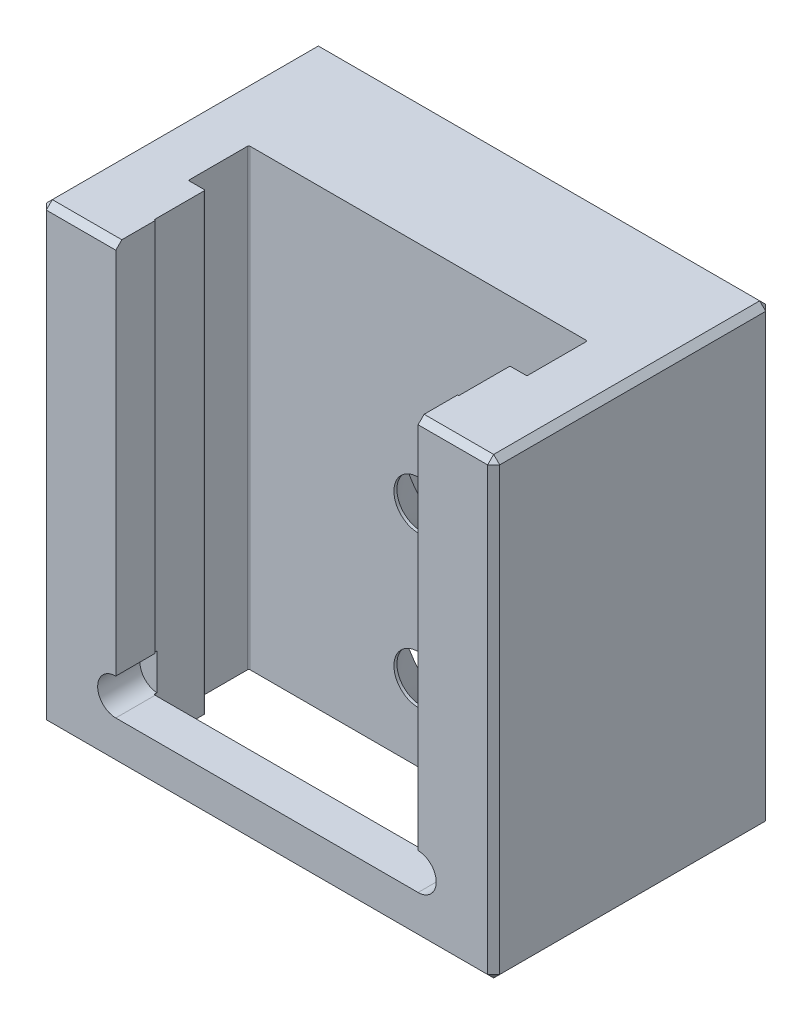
ISO-10303-21;
HEADER;
FILE_DESCRIPTION(('STEP AP214'),'2;1');
FILE_NAME('part.step','',(''),(''),'','','');
FILE_SCHEMA(('AUTOMOTIVE_DESIGN { 1 0 10303 214 1 1 1 1 }'));
ENDSEC;
DATA;
#1=APPLICATION_CONTEXT('core data for automotive mechanical design processes');
#2=APPLICATION_PROTOCOL_DEFINITION('international standard','automotive_design',2000,#1);
#3=PRODUCT_CONTEXT('',#1,'mechanical');
#4=PRODUCT('Part','Part','',(#3));
#5=PRODUCT_RELATED_PRODUCT_CATEGORY('part','',(#4));
#6=PRODUCT_DEFINITION_FORMATION('','',#4);
#7=PRODUCT_DEFINITION_CONTEXT('part definition',#1,'design');
#8=PRODUCT_DEFINITION('design','',#6,#7);
#9=PRODUCT_DEFINITION_SHAPE('','',#8);
#10=(LENGTH_UNIT() NAMED_UNIT(*) SI_UNIT(.MILLI.,.METRE.));
#11=(NAMED_UNIT(*) PLANE_ANGLE_UNIT() SI_UNIT($,.RADIAN.));
#12=(NAMED_UNIT(*) SI_UNIT($,.STERADIAN.) SOLID_ANGLE_UNIT());
#13=UNCERTAINTY_MEASURE_WITH_UNIT(LENGTH_MEASURE(1.E-05),#10,'distance_accuracy_value','');
#14=(GEOMETRIC_REPRESENTATION_CONTEXT(3) GLOBAL_UNCERTAINTY_ASSIGNED_CONTEXT((#13)) GLOBAL_UNIT_ASSIGNED_CONTEXT((#10,
#11,#12)) REPRESENTATION_CONTEXT('',''));
#15=CARTESIAN_POINT('',(0.,0.,0.));
#16=DIRECTION('',(0.,0.,1.));
#17=DIRECTION('',(1.,0.,0.));
#18=AXIS2_PLACEMENT_3D('',#15,#16,#17);
#19=CARTESIAN_POINT('',(-37.5,-37.5,1.));
#20=DIRECTION('',(0.,-0.707106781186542,-0.707106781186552));
#21=DIRECTION('',(-1.,0.,0.));
#22=AXIS2_PLACEMENT_3D('',#19,#20,#21);
#23=PLANE('',#22);
#24=DIRECTION('',(-1.,0.,0.));
#25=VECTOR('',#24,1.);
#26=CARTESIAN_POINT('',(-37.5,-36.5,0.));
#27=LINE('',#26,#25);
#28=CARTESIAN_POINT('',(-21.,-36.5,0.));
#29=VERTEX_POINT('',#28);
#30=CARTESIAN_POINT('',(-36.5,-36.5,0.));
#31=VERTEX_POINT('',#30);
#32=EDGE_CURVE('E539',#29,#31,#27,.T.);
#33=ORIENTED_EDGE('',*,*,#32,.F.);
#34=DIRECTION('',(0.577350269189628,-0.577350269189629,0.577350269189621));
#35=VECTOR('',#34,1.);
#36=CARTESIAN_POINT('',(-25.8333333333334,-31.6666666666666,-4.83333333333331));
#37=LINE('',#36,#35);
#38=CARTESIAN_POINT('',(-20.,-37.5,1.));
#39=VERTEX_POINT('',#38);
#40=EDGE_CURVE('E843',#29,#39,#37,.T.);
#41=ORIENTED_EDGE('',*,*,#40,.T.);
#42=DIRECTION('',(1.,0.,0.));
#43=VECTOR('',#42,1.);
#44=CARTESIAN_POINT('',(37.5,-37.5,1.));
#45=LINE('',#44,#43);
#46=CARTESIAN_POINT('',(-36.5,-37.5,1.));
#47=VERTEX_POINT('',#46);
#48=EDGE_CURVE('E530',#47,#39,#45,.T.);
#49=ORIENTED_EDGE('',*,*,#48,.F.);
#50=DIRECTION('',(0.,-0.707106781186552,0.707106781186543));
#51=VECTOR('',#50,1.);
#52=CARTESIAN_POINT('',(-36.5,-36.5,0.));
#53=LINE('',#52,#51);
#54=EDGE_CURVE('E585',#47,#31,#53,.F.);
#55=ORIENTED_EDGE('',*,*,#54,.T.);
#56=EDGE_LOOP('',(#33,#41,#49,#55));
#57=FACE_BOUND('',#56,.T.);
#58=ADVANCED_FACE('F36',(#57),#23,.T.);
#59=CARTESIAN_POINT('',(25.,-37.5,39.3));
#60=DIRECTION('',(0.,-1.,0.));
#61=DIRECTION('',(0.,0.,-1.));
#62=AXIS2_PLACEMENT_3D('',#59,#60,#61);
#63=CYLINDRICAL_SURFACE('',#62,0.2);
#64=DIRECTION('',(0.,1.,0.));
#65=VECTOR('',#64,1.);
#66=CARTESIAN_POINT('',(25.2,37.5,39.3));
#67=LINE('',#66,#65);
#68=CARTESIAN_POINT('',(25.2000000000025,-24.506674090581,39.3000000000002));
#69=VERTEX_POINT('',#68);
#70=CARTESIAN_POINT('',(25.2,37.5,39.3));
#71=VERTEX_POINT('',#70);
#72=EDGE_CURVE('E663',#69,#71,#67,.T.);
#73=ORIENTED_EDGE('',*,*,#72,.F.);
#74=CARTESIAN_POINT('',(25.,-24.5,39.1));
#75=CARTESIAN_POINT('',(25.0112207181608,-24.5000000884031,39.1000004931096));
#76=CARTESIAN_POINT('',(25.0224492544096,-24.500063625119,39.1009474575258));
#77=CARTESIAN_POINT('',(25.0445961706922,-24.500310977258,39.1047114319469));
#78=CARTESIAN_POINT('',(25.0555141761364,-24.5004949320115,39.10753060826));
#79=CARTESIAN_POINT('',(25.0767160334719,-24.500962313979,39.1149575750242));
#80=CARTESIAN_POINT('',(25.0870002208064,-24.5012456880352,39.1195644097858));
#81=CARTESIAN_POINT('',(25.1066466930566,-24.5018800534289,39.1304343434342));
#82=CARTESIAN_POINT('',(25.1160091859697,-24.5022310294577,39.1366970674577));
#83=CARTESIAN_POINT('',(25.1335649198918,-24.5029618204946,39.1507125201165));
#84=CARTESIAN_POINT('',(25.1417564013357,-24.5033416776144,39.1584674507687));
#85=CARTESIAN_POINT('',(25.1567225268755,-24.5040870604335,39.1752426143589));
#86=CARTESIAN_POINT('',(25.1634971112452,-24.5044525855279,39.1842629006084));
#87=CARTESIAN_POINT('',(25.1754426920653,-24.5051284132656,39.2033228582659));
#88=CARTESIAN_POINT('',(25.1806122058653,-24.5054386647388,39.2133634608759));
#89=CARTESIAN_POINT('',(25.1891914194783,-24.5059684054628,39.2341725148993));
#90=CARTESIAN_POINT('',(25.1926011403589,-24.5061878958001,39.2449409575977));
#91=CARTESIAN_POINT('',(25.1975590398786,-24.506510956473,39.2668828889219));
#92=CARTESIAN_POINT('',(25.1991100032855,-24.5066147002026,39.2780557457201));
#93=CARTESIAN_POINT('',(25.2003149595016,-24.5066950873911,39.3005036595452));
#94=CARTESIAN_POINT('',(25.1999689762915,-24.5066717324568,39.3117787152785));
#95=CARTESIAN_POINT('',(25.1973921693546,-24.5065007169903,39.334091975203));
#96=CARTESIAN_POINT('',(25.1951643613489,-24.5063532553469,39.3451305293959));
#97=CARTESIAN_POINT('',(25.1888918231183,-24.5059509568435,39.3666766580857));
#98=CARTESIAN_POINT('',(25.1848470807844,-24.505696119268,39.3771842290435));
#99=CARTESIAN_POINT('',(25.1750520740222,-24.5051075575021,39.3973797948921));
#100=CARTESIAN_POINT('',(25.1693004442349,-24.5047737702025,39.4070671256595));
#101=CARTESIAN_POINT('',(25.1562559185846,-24.5040649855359,39.4253399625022));
#102=CARTESIAN_POINT('',(25.1489630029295,-24.5036899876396,39.4339254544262));
#103=CARTESIAN_POINT('',(25.1330259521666,-24.5029401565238,39.4497684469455));
#104=CARTESIAN_POINT('',(25.1243792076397,-24.502565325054,39.4570233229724));
#105=CARTESIAN_POINT('',(25.1059890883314,-24.5018587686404,39.4699788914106));
#106=CARTESIAN_POINT('',(25.0962457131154,-24.5015270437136,39.475679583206));
#107=CARTESIAN_POINT('',(25.0759372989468,-24.5009440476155,39.4853647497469));
#108=CARTESIAN_POINT('',(25.0653722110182,-24.5006927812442,39.4893491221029));
#109=CARTESIAN_POINT('',(25.0437209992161,-24.5002990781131,39.4954867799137));
#110=CARTESIAN_POINT('',(25.0326348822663,-24.5001566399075,39.4976400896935));
#111=CARTESIAN_POINT('',(25.0102790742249,-24.4999968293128,39.5000512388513));
#112=CARTESIAN_POINT('',(24.9990097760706,-24.4999792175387,39.5003127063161));
#113=CARTESIAN_POINT('',(24.9765874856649,-24.500070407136,39.4989422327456));
#114=CARTESIAN_POINT('',(24.9654344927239,-24.5001792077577,39.4973103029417));
#115=CARTESIAN_POINT('',(24.9435716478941,-24.5005108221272,39.492202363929));
#116=CARTESIAN_POINT('',(24.9328614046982,-24.5007335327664,39.4887280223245));
#117=CARTESIAN_POINT('',(24.9121759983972,-24.5012679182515,39.4800355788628));
#118=CARTESIAN_POINT('',(24.9022008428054,-24.5015795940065,39.4748174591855));
#119=CARTESIAN_POINT('',(24.8832521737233,-24.5022575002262,39.4627763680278));
#120=CARTESIAN_POINT('',(24.8742802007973,-24.5026238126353,39.4559509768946));
#121=CARTESIAN_POINT('',(24.8576080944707,-24.5033695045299,39.4408926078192));
#122=CARTESIAN_POINT('',(24.8499079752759,-24.5037488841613,39.4326596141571));
#123=CARTESIAN_POINT('',(24.8359858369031,-24.5044786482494,39.415004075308));
#124=CARTESIAN_POINT('',(24.8297661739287,-24.5048289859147,39.4055796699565));
#125=CARTESIAN_POINT('',(24.8189976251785,-24.5054604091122,39.385818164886));
#126=CARTESIAN_POINT('',(24.8144487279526,-24.5057414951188,39.3754810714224));
#127=CARTESIAN_POINT('',(24.8071549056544,-24.5062023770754,39.3541961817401));
#128=CARTESIAN_POINT('',(24.804408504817,-24.5063822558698,39.3432488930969));
#129=CARTESIAN_POINT('',(24.80079281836,-24.506620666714,39.321047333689));
#130=CARTESIAN_POINT('',(24.7999235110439,-24.5066792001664,39.309793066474));
#131=CARTESIAN_POINT('',(24.800086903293,-24.5066682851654,39.2873204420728));
#132=CARTESIAN_POINT('',(24.8011158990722,-24.5065990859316,39.2761020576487));
#133=CARTESIAN_POINT('',(24.8050390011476,-24.5063410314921,39.2539977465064));
#134=CARTESIAN_POINT('',(24.807933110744,-24.5061521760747,39.2431118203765));
#135=CARTESIAN_POINT('',(24.8155034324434,-24.5056761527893,39.2219809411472));
#136=CARTESIAN_POINT('',(24.8201796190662,-24.5053889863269,39.2117359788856));
#137=CARTESIAN_POINT('',(24.8311808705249,-24.5047487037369,39.1921760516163));
#138=CARTESIAN_POINT('',(24.8375058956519,-24.5043955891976,39.1828610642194));
#139=CARTESIAN_POINT('',(24.8516390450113,-24.5036623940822,39.1654066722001));
#140=CARTESIAN_POINT('',(24.8594498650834,-24.5032822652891,39.1572694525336));
#141=CARTESIAN_POINT('',(24.8763289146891,-24.5025382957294,39.1424187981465));
#142=CARTESIAN_POINT('',(24.8853974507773,-24.5021744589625,39.1357057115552));
#143=CARTESIAN_POINT('',(24.9045460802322,-24.5015036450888,39.1238882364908));
#144=CARTESIAN_POINT('',(24.9146275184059,-24.5011967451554,39.1187860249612));
#145=CARTESIAN_POINT('',(24.9354987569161,-24.5006753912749,39.1103529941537));
#146=CARTESIAN_POINT('',(24.9462877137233,-24.5004608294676,39.1070201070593));
#147=CARTESIAN_POINT('',(24.9642852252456,-24.5002043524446,39.1030835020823));
#148=CARTESIAN_POINT('',(24.9713775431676,-24.5001280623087,39.1019286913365));
#149=CARTESIAN_POINT('',(24.9856455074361,-24.5000258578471,39.1003867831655));
#150=CARTESIAN_POINT('',(24.9928211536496,-24.499999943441,39.0999996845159));
#151=CARTESIAN_POINT('',(25.,-24.5,39.1));
#152=B_SPLINE_CURVE_WITH_KNOTS('',3,(#74,#75,#76,#77,#78,#79,#80,#81,#82,#83,#84,#85,#86,#87,
#88,#89,#90,#91,#92,#93,#94,#95,#96,#97,#98,#99,#100,#101,#102,#103,#104,#105,#106,#107,#108,
#109,#110,#111,#112,#113,#114,#115,#116,#117,#118,#119,#120,#121,#122,#123,#124,#125,#126,#127,
#128,#129,#130,#131,#132,#133,#134,#135,#136,#137,#138,#139,#140,#141,#142,#143,#144,#145,#146,
#147,#148,#149,#150,#151),.UNSPECIFIED.,.T.,.F.,(4,2,2,2,2,2,2,2,2,2,2,2,2,2,2,2,2,2,2,2,2,2,2,
2,2,2,2,2,2,2,2,2,2,2,2,2,2,2,4),(0.,0.0336359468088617,0.0673108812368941,0.100967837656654,
0.134617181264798,0.168316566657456,0.202017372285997,0.235749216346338,0.269480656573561,
0.303161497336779,0.336841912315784,0.370468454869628,0.404095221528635,0.437748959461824,
0.471403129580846,0.50512298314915,0.538842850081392,0.572564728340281,0.606286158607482,
0.639942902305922,0.673599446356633,0.707225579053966,0.740852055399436,0.774529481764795,
0.808207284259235,0.841938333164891,0.875669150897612,0.909372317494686,0.94307509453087,
0.97671218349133,1.01034933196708,1.04398599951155,1.07762185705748,1.11131933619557,
1.14502504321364,1.17877610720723,1.21248763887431,1.23400744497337,1.25552721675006),.UNSPECIFIED.);
#153=CARTESIAN_POINT('',(25.0000000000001,-24.4999999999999,39.5000000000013));
#154=VERTEX_POINT('',#153);
#155=EDGE_CURVE('E856',#69,#154,#152,.T.);
#156=ORIENTED_EDGE('',*,*,#155,.T.);
#157=DIRECTION('',(0.,-1.,0.));
#158=VECTOR('',#157,1.);
#159=CARTESIAN_POINT('',(25.,37.5,39.5));
#160=LINE('',#159,#158);
#161=CARTESIAN_POINT('',(25.,37.5,39.5));
#162=VERTEX_POINT('',#161);
#163=EDGE_CURVE('E447',#162,#154,#160,.T.);
#164=ORIENTED_EDGE('',*,*,#163,.F.);
#165=CARTESIAN_POINT('',(25.,37.5,39.3));
#166=DIRECTION('',(0.,-1.,0.));
#167=DIRECTION('',(0.,0.,-1.));
#168=AXIS2_PLACEMENT_3D('',#165,#166,#167);
#169=CIRCLE('',#168,0.2);
#170=EDGE_CURVE('E704',#71,#162,#169,.T.);
#171=ORIENTED_EDGE('',*,*,#170,.F.);
#172=EDGE_LOOP('',(#73,#156,#164,#171));
#173=FACE_BOUND('',#172,.T.);
#174=ADVANCED_FACE('F948',(#173),#63,.F.);
#175=CARTESIAN_POINT('',(-25.,-37.5,39.3));
#176=DIRECTION('',(0.,-1.,0.));
#177=DIRECTION('',(0.,0.,-1.));
#178=AXIS2_PLACEMENT_3D('',#175,#176,#177);
#179=CYLINDRICAL_SURFACE('',#178,0.2);
#180=DIRECTION('',(0.,1.,0.));
#181=VECTOR('',#180,1.);
#182=CARTESIAN_POINT('',(-25.,37.5,39.5));
#183=LINE('',#182,#181);
#184=CARTESIAN_POINT('',(-24.9999999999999,-24.4999999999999,39.5000000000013));
#185=VERTEX_POINT('',#184);
#186=CARTESIAN_POINT('',(-25.,37.5,39.5));
#187=VERTEX_POINT('',#186);
#188=EDGE_CURVE('E450',#185,#187,#183,.T.);
#189=ORIENTED_EDGE('',*,*,#188,.F.);
#190=CARTESIAN_POINT('',(-25.,-24.5,39.1));
#191=CARTESIAN_POINT('',(-24.9887792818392,-24.5000000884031,39.1000004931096));
#192=CARTESIAN_POINT('',(-24.9775507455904,-24.500063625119,39.1009474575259));
#193=CARTESIAN_POINT('',(-24.9554038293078,-24.500310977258,39.1047114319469));
#194=CARTESIAN_POINT('',(-24.9444858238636,-24.5004949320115,39.1075306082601));
#195=CARTESIAN_POINT('',(-24.9232839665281,-24.500962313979,39.1149575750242));
#196=CARTESIAN_POINT('',(-24.9129997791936,-24.5012456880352,39.1195644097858));
#197=CARTESIAN_POINT('',(-24.8933533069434,-24.5018800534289,39.1304343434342));
#198=CARTESIAN_POINT('',(-24.8839908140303,-24.5022310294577,39.1366970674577));
#199=CARTESIAN_POINT('',(-24.8664350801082,-24.5029618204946,39.1507125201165));
#200=CARTESIAN_POINT('',(-24.8582435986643,-24.5033416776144,39.1584674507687));
#201=CARTESIAN_POINT('',(-24.8432774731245,-24.5040870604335,39.1752426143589));
#202=CARTESIAN_POINT('',(-24.8365028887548,-24.5044525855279,39.1842629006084));
#203=CARTESIAN_POINT('',(-24.8245573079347,-24.5051284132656,39.2033228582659));
#204=CARTESIAN_POINT('',(-24.8193877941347,-24.5054386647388,39.2133634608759));
#205=CARTESIAN_POINT('',(-24.8108085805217,-24.5059684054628,39.2341725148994));
#206=CARTESIAN_POINT('',(-24.8073988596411,-24.5061878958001,39.2449409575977));
#207=CARTESIAN_POINT('',(-24.8024409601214,-24.506510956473,39.266882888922));
#208=CARTESIAN_POINT('',(-24.8008899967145,-24.5066147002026,39.2780557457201));
#209=CARTESIAN_POINT('',(-24.7996850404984,-24.5066950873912,39.3005036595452));
#210=CARTESIAN_POINT('',(-24.8000310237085,-24.5066717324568,39.3117787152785));
#211=CARTESIAN_POINT('',(-24.8026078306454,-24.5065007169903,39.3340919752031));
#212=CARTESIAN_POINT('',(-24.8048356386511,-24.5063532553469,39.3451305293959));
#213=CARTESIAN_POINT('',(-24.8111081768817,-24.5059509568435,39.3666766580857));
#214=CARTESIAN_POINT('',(-24.8151529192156,-24.505696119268,39.3771842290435));
#215=CARTESIAN_POINT('',(-24.8249479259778,-24.5051075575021,39.3973797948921));
#216=CARTESIAN_POINT('',(-24.8306995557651,-24.5047737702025,39.4070671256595));
#217=CARTESIAN_POINT('',(-24.8437440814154,-24.5040649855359,39.4253399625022));
#218=CARTESIAN_POINT('',(-24.8510369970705,-24.5036899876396,39.4339254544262));
#219=CARTESIAN_POINT('',(-24.8669740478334,-24.5029401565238,39.4497684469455));
#220=CARTESIAN_POINT('',(-24.8756207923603,-24.502565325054,39.4570233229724));
#221=CARTESIAN_POINT('',(-24.8940109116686,-24.5018587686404,39.4699788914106));
#222=CARTESIAN_POINT('',(-24.9037542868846,-24.5015270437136,39.475679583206));
#223=CARTESIAN_POINT('',(-24.9240627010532,-24.5009440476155,39.4853647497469));
#224=CARTESIAN_POINT('',(-24.9346277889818,-24.5006927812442,39.4893491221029));
#225=CARTESIAN_POINT('',(-24.9562790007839,-24.5002990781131,39.4954867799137));
#226=CARTESIAN_POINT('',(-24.9673651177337,-24.5001566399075,39.4976400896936));
#227=CARTESIAN_POINT('',(-24.9897209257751,-24.4999968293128,39.5000512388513));
#228=CARTESIAN_POINT('',(-25.0009902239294,-24.4999792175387,39.5003127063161));
#229=CARTESIAN_POINT('',(-25.0234125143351,-24.5000704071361,39.4989422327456));
#230=CARTESIAN_POINT('',(-25.0345655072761,-24.5001792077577,39.4973103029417));
#231=CARTESIAN_POINT('',(-25.0564283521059,-24.5005108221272,39.492202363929));
#232=CARTESIAN_POINT('',(-25.0671385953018,-24.5007335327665,39.4887280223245));
#233=CARTESIAN_POINT('',(-25.0878240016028,-24.5012679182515,39.4800355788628));
#234=CARTESIAN_POINT('',(-25.0977991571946,-24.5015795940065,39.4748174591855));
#235=CARTESIAN_POINT('',(-25.1167478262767,-24.5022575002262,39.4627763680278));
#236=CARTESIAN_POINT('',(-25.1257197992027,-24.5026238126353,39.4559509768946));
#237=CARTESIAN_POINT('',(-25.1423919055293,-24.5033695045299,39.4408926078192));
#238=CARTESIAN_POINT('',(-25.1500920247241,-24.5037488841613,39.4326596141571));
#239=CARTESIAN_POINT('',(-25.1640141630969,-24.5044786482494,39.415004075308));
#240=CARTESIAN_POINT('',(-25.1702338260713,-24.5048289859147,39.4055796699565));
#241=CARTESIAN_POINT('',(-25.1810023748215,-24.5054604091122,39.385818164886));
#242=CARTESIAN_POINT('',(-25.1855512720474,-24.5057414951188,39.3754810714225));
#243=CARTESIAN_POINT('',(-25.1928450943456,-24.5062023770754,39.3541961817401));
#244=CARTESIAN_POINT('',(-25.195591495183,-24.5063822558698,39.3432488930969));
#245=CARTESIAN_POINT('',(-25.19920718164,-24.506620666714,39.321047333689));
#246=CARTESIAN_POINT('',(-25.2000764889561,-24.5066792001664,39.309793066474));
#247=CARTESIAN_POINT('',(-25.199913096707,-24.5066682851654,39.2873204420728));
#248=CARTESIAN_POINT('',(-25.1988841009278,-24.5065990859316,39.2761020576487));
#249=CARTESIAN_POINT('',(-25.1949609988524,-24.5063410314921,39.2539977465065));
#250=CARTESIAN_POINT('',(-25.192066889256,-24.5061521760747,39.2431118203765));
#251=CARTESIAN_POINT('',(-25.1844965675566,-24.5056761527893,39.2219809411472));
#252=CARTESIAN_POINT('',(-25.1798203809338,-24.5053889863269,39.2117359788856));
#253=CARTESIAN_POINT('',(-25.168819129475,-24.5047487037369,39.1921760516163));
#254=CARTESIAN_POINT('',(-25.162494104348,-24.5043955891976,39.1828610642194));
#255=CARTESIAN_POINT('',(-25.1483609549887,-24.5036623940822,39.1654066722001));
#256=CARTESIAN_POINT('',(-25.1405501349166,-24.5032822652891,39.1572694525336));
#257=CARTESIAN_POINT('',(-25.1236710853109,-24.5025382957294,39.1424187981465));
#258=CARTESIAN_POINT('',(-25.1146025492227,-24.5021744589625,39.1357057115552));
#259=CARTESIAN_POINT('',(-25.0954539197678,-24.5015036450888,39.1238882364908));
#260=CARTESIAN_POINT('',(-25.0853724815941,-24.5011967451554,39.1187860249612));
#261=CARTESIAN_POINT('',(-25.0645012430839,-24.5006753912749,39.1103529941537));
#262=CARTESIAN_POINT('',(-25.0537122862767,-24.5004608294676,39.1070201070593));
#263=CARTESIAN_POINT('',(-25.0357147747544,-24.5002043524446,39.1030835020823));
#264=CARTESIAN_POINT('',(-25.0286224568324,-24.5001280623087,39.1019286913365));
#265=CARTESIAN_POINT('',(-25.0143544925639,-24.5000258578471,39.1003867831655));
#266=CARTESIAN_POINT('',(-25.0071788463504,-24.4999999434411,39.0999996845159));
#267=CARTESIAN_POINT('',(-25.,-24.5,39.1));
#268=B_SPLINE_CURVE_WITH_KNOTS('',3,(#190,#191,#192,#193,#194,#195,#196,#197,#198,#199,#200,
#201,#202,#203,#204,#205,#206,#207,#208,#209,#210,#211,#212,#213,#214,#215,#216,#217,#218,#219,
#220,#221,#222,#223,#224,#225,#226,#227,#228,#229,#230,#231,#232,#233,#234,#235,#236,#237,#238,
#239,#240,#241,#242,#243,#244,#245,#246,#247,#248,#249,#250,#251,#252,#253,#254,#255,#256,#257,
#258,#259,#260,#261,#262,#263,#264,#265,#266,#267),.UNSPECIFIED.,.T.,.F.,(4,2,2,2,2,2,2,2,2,2,2,
2,2,2,2,2,2,2,2,2,2,2,2,2,2,2,2,2,2,2,2,2,2,2,2,2,2,2,4),(0.,0.0336359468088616,
0.0673108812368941,0.10096783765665,0.134617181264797,0.168316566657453,0.202017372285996,
0.235749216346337,0.26948065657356,0.303161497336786,0.336841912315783,0.370468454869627,
0.404095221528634,0.437748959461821,0.471403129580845,0.50512298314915,0.538842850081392,
0.572564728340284,0.606286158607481,0.639942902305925,0.673599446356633,0.707225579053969,
0.740852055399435,0.774529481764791,0.808207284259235,0.841938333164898,0.875669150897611,
0.909372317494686,0.943075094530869,0.976712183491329,1.01034933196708,1.04398599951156,
1.07762185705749,1.11131933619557,1.14502504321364,1.17877610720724,1.21248763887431,
1.23400744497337,1.25552721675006),.UNSPECIFIED.);
#269=CARTESIAN_POINT('',(-25.2,-24.5066740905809,39.3));
#270=VERTEX_POINT('',#269);
#271=EDGE_CURVE('E731',#185,#270,#268,.T.);
#272=ORIENTED_EDGE('',*,*,#271,.T.);
#273=DIRECTION('',(0.,1.,0.));
#274=VECTOR('',#273,1.);
#275=CARTESIAN_POINT('',(-25.2,-37.5,39.3));
#276=LINE('',#275,#274);
#277=CARTESIAN_POINT('',(-25.2,37.5,39.3));
#278=VERTEX_POINT('',#277);
#279=EDGE_CURVE('E658',#278,#270,#276,.F.);
#280=ORIENTED_EDGE('',*,*,#279,.F.);
#281=CARTESIAN_POINT('',(-25.,37.5,39.3));
#282=DIRECTION('',(0.,-1.,0.));
#283=DIRECTION('',(0.,0.,-1.));
#284=AXIS2_PLACEMENT_3D('',#281,#282,#283);
#285=CIRCLE('',#284,0.2);
#286=EDGE_CURVE('E700',#187,#278,#285,.T.);
#287=ORIENTED_EDGE('',*,*,#286,.F.);
#288=EDGE_LOOP('',(#189,#272,#280,#287));
#289=FACE_BOUND('',#288,.T.);
#290=ADVANCED_FACE('F953',(#289),#179,.F.);
#291=CARTESIAN_POINT('',(0.,36.5,46.));
#292=DIRECTION('',(0.,-0.707106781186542,-0.707106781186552));
#293=DIRECTION('',(-1.,0.,0.));
#294=AXIS2_PLACEMENT_3D('',#291,#292,#293);
#295=PLANE('',#294);
#296=DIRECTION('',(0.,0.707106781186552,-0.707106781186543));
#297=VECTOR('',#296,1.);
#298=CARTESIAN_POINT('',(-25.,36.5,46.));
#299=LINE('',#298,#297);
#300=CARTESIAN_POINT('',(-25.,37.5,45.));
#301=VERTEX_POINT('',#300);
#302=CARTESIAN_POINT('',(-25.,36.5,46.));
#303=VERTEX_POINT('',#302);
#304=EDGE_CURVE('E474',#301,#303,#299,.F.);
#305=ORIENTED_EDGE('',*,*,#304,.F.);
#306=DIRECTION('',(1.,0.,0.));
#307=VECTOR('',#306,1.);
#308=CARTESIAN_POINT('',(-37.5,37.5,45.));
#309=LINE('',#308,#307);
#310=CARTESIAN_POINT('',(-36.5,37.5,45.));
#311=VERTEX_POINT('',#310);
#312=EDGE_CURVE('E555',#311,#301,#309,.T.);
#313=ORIENTED_EDGE('',*,*,#312,.F.);
#314=DIRECTION('',(0.,-0.707106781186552,0.707106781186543));
#315=VECTOR('',#314,1.);
#316=CARTESIAN_POINT('',(-36.5,36.5,46.));
#317=LINE('',#316,#315);
#318=CARTESIAN_POINT('',(-36.5,36.5,46.));
#319=VERTEX_POINT('',#318);
#320=EDGE_CURVE('E525',#319,#311,#317,.F.);
#321=ORIENTED_EDGE('',*,*,#320,.F.);
#322=DIRECTION('',(-1.,0.,0.));
#323=VECTOR('',#322,1.);
#324=CARTESIAN_POINT('',(0.,36.5,46.));
#325=LINE('',#324,#323);
#326=EDGE_CURVE('E578',#303,#319,#325,.T.);
#327=ORIENTED_EDGE('',*,*,#326,.F.);
#328=EDGE_LOOP('',(#305,#313,#321,#327));
#329=FACE_BOUND('',#328,.T.);
#330=ADVANCED_FACE('F1035',(#329),#295,.F.);
#331=CARTESIAN_POINT('',(-37.5,-37.5,46.));
#332=DIRECTION('',(1.,0.,0.));
#333=DIRECTION('',(0.,0.,-1.));
#334=AXIS2_PLACEMENT_3D('',#331,#332,#333);
#335=PLANE('',#334);
#336=DIRECTION('',(0.,0.,-1.));
#337=VECTOR('',#336,1.);
#338=CARTESIAN_POINT('',(-37.5,36.5,46.));
#339=LINE('',#338,#337);
#340=CARTESIAN_POINT('',(-37.5,36.5,45.));
#341=VERTEX_POINT('',#340);
#342=CARTESIAN_POINT('',(-37.5,36.5,1.));
#343=VERTEX_POINT('',#342);
#344=EDGE_CURVE('E567',#341,#343,#339,.T.);
#345=ORIENTED_EDGE('',*,*,#344,.T.);
#346=DIRECTION('',(0.,-1.,0.));
#347=VECTOR('',#346,1.);
#348=CARTESIAN_POINT('',(-37.5,-37.5,1.));
#349=LINE('',#348,#347);
#350=CARTESIAN_POINT('',(-37.5,-36.5,1.));
#351=VERTEX_POINT('',#350);
#352=EDGE_CURVE('E569',#343,#351,#349,.T.);
#353=ORIENTED_EDGE('',*,*,#352,.T.);
#354=DIRECTION('',(0.,0.,1.));
#355=VECTOR('',#354,1.);
#356=CARTESIAN_POINT('',(-37.5,-36.5,46.));
#357=LINE('',#356,#355);
#358=CARTESIAN_POINT('',(-37.5,-36.5,45.));
#359=VERTEX_POINT('',#358);
#360=EDGE_CURVE('E563',#351,#359,#357,.T.);
#361=ORIENTED_EDGE('',*,*,#360,.T.);
#362=DIRECTION('',(0.,1.,0.));
#363=VECTOR('',#362,1.);
#364=CARTESIAN_POINT('',(-37.5,-37.5,45.));
#365=LINE('',#364,#363);
#366=EDGE_CURVE('E565',#359,#341,#365,.T.);
#367=ORIENTED_EDGE('',*,*,#366,.T.);
#368=EDGE_LOOP('',(#345,#353,#361,#367));
#369=FACE_BOUND('',#368,.T.);
#370=ADVANCED_FACE('F815',(#369),#335,.F.);
#371=CARTESIAN_POINT('',(-37.5,-37.5,46.));
#372=DIRECTION('',(0.,1.,0.));
#373=DIRECTION('',(0.,0.,1.));
#374=AXIS2_PLACEMENT_3D('',#371,#372,#373);
#375=PLANE('',#374);
#376=DIRECTION('',(-1.,0.,0.));
#377=VECTOR('',#376,1.);
#378=CARTESIAN_POINT('',(-20.,-37.5,10.));
#379=LINE('',#378,#377);
#380=CARTESIAN_POINT('',(-7.34846922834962,-37.5,10.));
#381=VERTEX_POINT('',#380);
#382=CARTESIAN_POINT('',(-20.,-37.5,10.));
#383=VERTEX_POINT('',#382);
#384=EDGE_CURVE('E400',#381,#383,#379,.T.);
#385=ORIENTED_EDGE('',*,*,#384,.F.);
#386=CARTESIAN_POINT('',(-7.34846922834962,-37.5,10.));
#387=CARTESIAN_POINT('',(-7.09629748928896,-37.5,10.1277747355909));
#388=CARTESIAN_POINT('',(-6.84213118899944,-37.5,10.2517179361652));
#389=CARTESIAN_POINT('',(-6.3294783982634,-37.5,10.4906937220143));
#390=CARTESIAN_POINT('',(-6.07098956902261,-37.5,10.6057212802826));
#391=CARTESIAN_POINT('',(-5.54806794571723,-37.5,10.8261359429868));
#392=CARTESIAN_POINT('',(-5.28360867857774,-37.5,10.9314606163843));
#393=CARTESIAN_POINT('',(-4.75025016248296,-37.5,11.1301221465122));
#394=CARTESIAN_POINT('',(-4.48135162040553,-37.5,11.223460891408));
#395=CARTESIAN_POINT('',(-3.94360839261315,-37.5,11.3951075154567));
#396=CARTESIAN_POINT('',(-3.67483451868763,-37.5,11.4736359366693));
#397=CARTESIAN_POINT('',(-3.13340705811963,-37.5,11.6158998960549));
#398=CARTESIAN_POINT('',(-2.86075391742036,-37.5,11.6796371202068));
#399=CARTESIAN_POINT('',(-2.31276947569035,-37.5,11.7906675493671));
#400=CARTESIAN_POINT('',(-2.0374461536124,-37.5,11.8379997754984));
#401=CARTESIAN_POINT('',(-1.48440112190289,-37.5,11.9151507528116));
#402=CARTESIAN_POINT('',(-1.20667980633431,-37.5,11.9449723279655));
#403=CARTESIAN_POINT('',(-0.53660945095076,-37.5,11.9945703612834));
#404=CARTESIAN_POINT('',(-0.143550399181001,-37.5,12.0053372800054));
#405=CARTESIAN_POINT('',(0.641923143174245,-37.5,11.9896957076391));
#406=CARTESIAN_POINT('',(1.03433735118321,-37.5,11.9632738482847));
#407=CARTESIAN_POINT('',(1.81553936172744,-37.5,11.8748145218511));
#408=CARTESIAN_POINT('',(2.2043222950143,-37.5,11.8127347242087));
#409=CARTESIAN_POINT('',(2.97522839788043,-37.5,11.6563478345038));
#410=CARTESIAN_POINT('',(3.35735205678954,-37.5,11.5620431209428));
#411=CARTESIAN_POINT('',(4.04842996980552,-37.5,11.3641813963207));
#412=CARTESIAN_POINT('',(4.35866197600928,-37.5,11.2650075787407));
#413=CARTESIAN_POINT('',(4.97331973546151,-37.5,11.0500550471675));
#414=CARTESIAN_POINT('',(5.27774501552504,-37.5,10.9342749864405));
#415=CARTESIAN_POINT('',(5.87985673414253,-37.5,10.6888720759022));
#416=CARTESIAN_POINT('',(6.1775605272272,-37.5,10.5592914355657));
#417=CARTESIAN_POINT('',(6.76720882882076,-37.5,10.2881411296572));
#418=CARTESIAN_POINT('',(7.05915738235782,-37.5,10.1465802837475));
#419=CARTESIAN_POINT('',(7.34846922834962,-37.5,10.));
#420=B_SPLINE_CURVE_WITH_KNOTS('',3,(#386,#387,#388,#389,#390,#391,#392,#393,#394,#395,#396,
#397,#398,#399,#400,#401,#402,#403,#404,#405,#406,#407,#408,#409,#410,#411,#412,#413,#414,#415,
#416,#417,#418,#419),.UNSPECIFIED.,.F.,.F.,(4,2,2,2,2,2,2,2,2,2,2,2,2,2,2,2,4),(0.,
0.848125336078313,1.69672545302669,2.55045159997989,3.40404309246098,4.24369696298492,
5.08325507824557,5.92080228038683,6.75821437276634,7.93599577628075,9.11420066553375,
10.2938071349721,11.4733265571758,12.4499152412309,13.4265831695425,14.4003453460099,
15.3733967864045),.UNSPECIFIED.);
#421=CARTESIAN_POINT('',(7.34846922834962,-37.5,10.));
#422=VERTEX_POINT('',#421);
#423=EDGE_CURVE('E48',#381,#422,#420,.T.);
#424=ORIENTED_EDGE('',*,*,#423,.T.);
#425=CARTESIAN_POINT('',(20.,-37.5,10.));
#426=VERTEX_POINT('',#425);
#427=EDGE_CURVE('E401',#426,#422,#379,.T.);
#428=ORIENTED_EDGE('',*,*,#427,.F.);
#429=DIRECTION('',(0.,0.,-1.));
#430=VECTOR('',#429,1.);
#431=CARTESIAN_POINT('',(20.,-37.5,10.));
#432=LINE('',#431,#430);
#433=CARTESIAN_POINT('',(20.,-37.5,1.));
#434=VERTEX_POINT('',#433);
#435=EDGE_CURVE('E414',#426,#434,#432,.T.);
#436=ORIENTED_EDGE('',*,*,#435,.T.);
#437=CARTESIAN_POINT('',(36.5,-37.5,1.));
#438=VERTEX_POINT('',#437);
#439=EDGE_CURVE('E529',#434,#438,#45,.T.);
#440=ORIENTED_EDGE('',*,*,#439,.T.);
#441=DIRECTION('',(0.,0.,1.));
#442=VECTOR('',#441,1.);
#443=CARTESIAN_POINT('',(36.5,-37.5,46.));
#444=LINE('',#443,#442);
#445=CARTESIAN_POINT('',(36.5,-37.5,45.));
#446=VERTEX_POINT('',#445);
#447=EDGE_CURVE('E522',#438,#446,#444,.T.);
#448=ORIENTED_EDGE('',*,*,#447,.T.);
#449=DIRECTION('',(-1.,0.,0.));
#450=VECTOR('',#449,1.);
#451=CARTESIAN_POINT('',(-37.5,-37.5,45.));
#452=LINE('',#451,#450);
#453=CARTESIAN_POINT('',(-36.5,-37.5,45.));
#454=VERTEX_POINT('',#453);
#455=EDGE_CURVE('E524',#446,#454,#452,.T.);
#456=ORIENTED_EDGE('',*,*,#455,.T.);
#457=DIRECTION('',(0.,0.,-1.));
#458=VECTOR('',#457,1.);
#459=CARTESIAN_POINT('',(-36.5,-37.5,46.));
#460=LINE('',#459,#458);
#461=EDGE_CURVE('E527',#454,#47,#460,.T.);
#462=ORIENTED_EDGE('',*,*,#461,.T.);
#463=ORIENTED_EDGE('',*,*,#48,.T.);
#464=DIRECTION('',(0.,0.,-1.));
#465=VECTOR('',#464,1.);
#466=CARTESIAN_POINT('',(-20.,-37.5,10.));
#467=LINE('',#466,#465);
#468=EDGE_CURVE('E411',#383,#39,#467,.T.);
#469=ORIENTED_EDGE('',*,*,#468,.F.);
#470=EDGE_LOOP('',(#385,#424,#428,#436,#440,#448,#456,#462,#463,#469));
#471=FACE_BOUND('',#470,.T.);
#472=DIRECTION('',(0.,0.,-1.));
#473=VECTOR('',#472,1.);
#474=CARTESIAN_POINT('',(25.2,-37.5,31.));
#475=LINE('',#474,#473);
#476=CARTESIAN_POINT('',(25.2,-37.5,39.3));
#477=VERTEX_POINT('',#476);
#478=CARTESIAN_POINT('',(25.2,-37.5,31.2));
#479=VERTEX_POINT('',#478);
#480=EDGE_CURVE('E490',#477,#479,#475,.T.);
#481=ORIENTED_EDGE('',*,*,#480,.T.);
#482=CARTESIAN_POINT('',(25.4,-37.5,31.2));
#483=DIRECTION('',(0.,1.,0.));
#484=DIRECTION('',(0.,0.,1.));
#485=AXIS2_PLACEMENT_3D('',#482,#483,#484);
#486=CIRCLE('',#485,0.2);
#487=CARTESIAN_POINT('',(25.4,-37.5,31.));
#488=VERTEX_POINT('',#487);
#489=EDGE_CURVE('E678',#479,#488,#486,.F.);
#490=ORIENTED_EDGE('',*,*,#489,.T.);
#491=DIRECTION('',(1.,0.,0.));
#492=VECTOR('',#491,1.);
#493=CARTESIAN_POINT('',(25.2,-37.5,31.));
#494=LINE('',#493,#492);
#495=CARTESIAN_POINT('',(27.8,-37.5,31.));
#496=VERTEX_POINT('',#495);
#497=EDGE_CURVE('E493',#488,#496,#494,.T.);
#498=ORIENTED_EDGE('',*,*,#497,.T.);
#499=CARTESIAN_POINT('',(27.8,-37.5,30.8));
#500=DIRECTION('',(0.,1.,0.));
#501=DIRECTION('',(0.,0.,1.));
#502=AXIS2_PLACEMENT_3D('',#499,#500,#501);
#503=CIRCLE('',#502,0.2);
#504=CARTESIAN_POINT('',(28.,-37.5,30.8));
#505=VERTEX_POINT('',#504);
#506=EDGE_CURVE('E710',#496,#505,#503,.T.);
#507=ORIENTED_EDGE('',*,*,#506,.T.);
#508=DIRECTION('',(0.,0.,-1.));
#509=VECTOR('',#508,1.);
#510=CARTESIAN_POINT('',(28.,-37.5,31.));
#511=LINE('',#510,#509);
#512=CARTESIAN_POINT('',(28.,-37.5,21.2));
#513=VERTEX_POINT('',#512);
#514=EDGE_CURVE('E496',#505,#513,#511,.T.);
#515=ORIENTED_EDGE('',*,*,#514,.T.);
#516=CARTESIAN_POINT('',(27.8,-37.5,21.2));
#517=DIRECTION('',(0.,1.,0.));
#518=DIRECTION('',(0.,0.,1.));
#519=AXIS2_PLACEMENT_3D('',#516,#517,#518);
#520=CIRCLE('',#519,0.2);
#521=CARTESIAN_POINT('',(27.8,-37.5,21.));
#522=VERTEX_POINT('',#521);
#523=EDGE_CURVE('E714',#513,#522,#520,.T.);
#524=ORIENTED_EDGE('',*,*,#523,.T.);
#525=DIRECTION('',(-1.,0.,0.));
#526=VECTOR('',#525,1.);
#527=CARTESIAN_POINT('',(-28.,-37.5,21.));
#528=LINE('',#527,#526);
#529=CARTESIAN_POINT('',(-27.8,-37.5,21.));
#530=VERTEX_POINT('',#529);
#531=EDGE_CURVE('E499',#522,#530,#528,.T.);
#532=ORIENTED_EDGE('',*,*,#531,.T.);
#533=CARTESIAN_POINT('',(-27.8,-37.5,21.2));
#534=DIRECTION('',(0.,1.,0.));
#535=DIRECTION('',(0.,0.,1.));
#536=AXIS2_PLACEMENT_3D('',#533,#534,#535);
#537=CIRCLE('',#536,0.2);
#538=CARTESIAN_POINT('',(-28.,-37.5,21.2));
#539=VERTEX_POINT('',#538);
#540=EDGE_CURVE('E718',#530,#539,#537,.T.);
#541=ORIENTED_EDGE('',*,*,#540,.T.);
#542=DIRECTION('',(0.,0.,1.));
#543=VECTOR('',#542,1.);
#544=CARTESIAN_POINT('',(-28.,-37.5,31.));
#545=LINE('',#544,#543);
#546=CARTESIAN_POINT('',(-28.,-37.5,30.8));
#547=VERTEX_POINT('',#546);
#548=EDGE_CURVE('E477',#539,#547,#545,.T.);
#549=ORIENTED_EDGE('',*,*,#548,.T.);
#550=CARTESIAN_POINT('',(-27.8,-37.5,30.8));
#551=DIRECTION('',(0.,1.,0.));
#552=DIRECTION('',(0.,0.,1.));
#553=AXIS2_PLACEMENT_3D('',#550,#551,#552);
#554=CIRCLE('',#553,0.2);
#555=CARTESIAN_POINT('',(-27.8,-37.5,31.));
#556=VERTEX_POINT('',#555);
#557=EDGE_CURVE('E722',#547,#556,#554,.T.);
#558=ORIENTED_EDGE('',*,*,#557,.T.);
#559=DIRECTION('',(1.,0.,0.));
#560=VECTOR('',#559,1.);
#561=CARTESIAN_POINT('',(-28.,-37.5,31.));
#562=LINE('',#561,#560);
#563=CARTESIAN_POINT('',(-25.4,-37.5,31.));
#564=VERTEX_POINT('',#563);
#565=EDGE_CURVE('E480',#556,#564,#562,.T.);
#566=ORIENTED_EDGE('',*,*,#565,.T.);
#567=CARTESIAN_POINT('',(-25.4,-37.5,31.2));
#568=DIRECTION('',(0.,1.,0.));
#569=DIRECTION('',(0.,0.,1.));
#570=AXIS2_PLACEMENT_3D('',#567,#568,#569);
#571=CIRCLE('',#570,0.2);
#572=CARTESIAN_POINT('',(-25.2,-37.5,31.2));
#573=VERTEX_POINT('',#572);
#574=EDGE_CURVE('E676',#564,#573,#571,.F.);
#575=ORIENTED_EDGE('',*,*,#574,.T.);
#576=DIRECTION('',(0.,0.,1.));
#577=VECTOR('',#576,1.);
#578=CARTESIAN_POINT('',(-25.2,-37.5,31.));
#579=LINE('',#578,#577);
#580=CARTESIAN_POINT('',(-25.2,-37.5,39.3));
#581=VERTEX_POINT('',#580);
#582=EDGE_CURVE('E484',#573,#581,#579,.T.);
#583=ORIENTED_EDGE('',*,*,#582,.T.);
#584=CARTESIAN_POINT('',(-25.,-37.5,39.3));
#585=DIRECTION('',(0.,1.,0.));
#586=DIRECTION('',(0.,0.,1.));
#587=AXIS2_PLACEMENT_3D('',#584,#585,#586);
#588=CIRCLE('',#587,0.2);
#589=CARTESIAN_POINT('',(-25.,-37.5,39.5));
#590=VERTEX_POINT('',#589);
#591=EDGE_CURVE('E702',#581,#590,#588,.T.);
#592=ORIENTED_EDGE('',*,*,#591,.T.);
#593=DIRECTION('',(1.,0.,0.));
#594=VECTOR('',#593,1.);
#595=CARTESIAN_POINT('',(-25.2,-37.5,39.5));
#596=LINE('',#595,#594);
#597=CARTESIAN_POINT('',(25.,-37.5,39.5));
#598=VERTEX_POINT('',#597);
#599=EDGE_CURVE('E487',#590,#598,#596,.T.);
#600=ORIENTED_EDGE('',*,*,#599,.T.);
#601=CARTESIAN_POINT('',(25.,-37.5,39.3));
#602=DIRECTION('',(0.,1.,0.));
#603=DIRECTION('',(0.,0.,1.));
#604=AXIS2_PLACEMENT_3D('',#601,#602,#603);
#605=CIRCLE('',#604,0.2);
#606=EDGE_CURVE('E706',#598,#477,#605,.T.);
#607=ORIENTED_EDGE('',*,*,#606,.T.);
#608=EDGE_LOOP('',(#481,#490,#498,#507,#515,#524,#532,#541,#549,#558,#566,#575,#583,#592,#600,#607));
#609=FACE_BOUND('',#608,.T.);
#610=ADVANCED_FACE('F810',(#471,#609),#375,.F.);
#611=CARTESIAN_POINT('',(37.5,-37.5,46.));
#612=DIRECTION('',(-1.,0.,0.));
#613=DIRECTION('',(0.,0.,1.));
#614=AXIS2_PLACEMENT_3D('',#611,#612,#613);
#615=PLANE('',#614);
#616=DIRECTION('',(0.,0.,-1.));
#617=VECTOR('',#616,1.);
#618=CARTESIAN_POINT('',(37.5,-36.5,46.));
#619=LINE('',#618,#617);
#620=CARTESIAN_POINT('',(37.5,-36.5,45.));
#621=VERTEX_POINT('',#620);
#622=CARTESIAN_POINT('',(37.5,-36.5,1.00000000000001));
#623=VERTEX_POINT('',#622);
#624=EDGE_CURVE('E547',#621,#623,#619,.T.);
#625=ORIENTED_EDGE('',*,*,#624,.T.);
#626=DIRECTION('',(0.,1.,0.));
#627=VECTOR('',#626,1.);
#628=CARTESIAN_POINT('',(37.5,37.5,1.00000000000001));
#629=LINE('',#628,#627);
#630=CARTESIAN_POINT('',(37.5,36.5,1.00000000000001));
#631=VERTEX_POINT('',#630);
#632=EDGE_CURVE('E549',#623,#631,#629,.T.);
#633=ORIENTED_EDGE('',*,*,#632,.T.);
#634=DIRECTION('',(0.,0.,1.));
#635=VECTOR('',#634,1.);
#636=CARTESIAN_POINT('',(37.5,36.5,46.));
#637=LINE('',#636,#635);
#638=CARTESIAN_POINT('',(37.5,36.5,45.));
#639=VERTEX_POINT('',#638);
#640=EDGE_CURVE('E543',#631,#639,#637,.T.);
#641=ORIENTED_EDGE('',*,*,#640,.T.);
#642=DIRECTION('',(0.,-1.,0.));
#643=VECTOR('',#642,1.);
#644=CARTESIAN_POINT('',(37.5,-37.5,45.));
#645=LINE('',#644,#643);
#646=EDGE_CURVE('E545',#639,#621,#645,.T.);
#647=ORIENTED_EDGE('',*,*,#646,.T.);
#648=EDGE_LOOP('',(#625,#633,#641,#647));
#649=FACE_BOUND('',#648,.T.);
#650=ADVANCED_FACE('F806',(#649),#615,.F.);
#651=CARTESIAN_POINT('',(-37.5,37.5,46.));
#652=DIRECTION('',(0.,-1.,0.));
#653=DIRECTION('',(0.,0.,-1.));
#654=AXIS2_PLACEMENT_3D('',#651,#652,#653);
#655=PLANE('',#654);
#656=DIRECTION('',(1.,0.,0.));
#657=VECTOR('',#656,1.);
#658=CARTESIAN_POINT('',(25.2,37.5,31.));
#659=LINE('',#658,#657);
#660=CARTESIAN_POINT('',(25.4,37.5,31.));
#661=VERTEX_POINT('',#660);
#662=CARTESIAN_POINT('',(27.8,37.5,31.));
#663=VERTEX_POINT('',#662);
#664=EDGE_CURVE('E514',#661,#663,#659,.T.);
#665=ORIENTED_EDGE('',*,*,#664,.F.);
#666=CARTESIAN_POINT('',(25.4,37.5,31.2));
#667=DIRECTION('',(0.,-1.,0.));
#668=DIRECTION('',(0.,0.,-1.));
#669=AXIS2_PLACEMENT_3D('',#666,#667,#668);
#670=CIRCLE('',#669,0.2);
#671=CARTESIAN_POINT('',(25.2,37.5,31.2));
#672=VERTEX_POINT('',#671);
#673=EDGE_CURVE('E674',#661,#672,#670,.F.);
#674=ORIENTED_EDGE('',*,*,#673,.T.);
#675=DIRECTION('',(0.,0.,-1.));
#676=VECTOR('',#675,1.);
#677=CARTESIAN_POINT('',(25.2,37.5,31.));
#678=LINE('',#677,#676);
#679=EDGE_CURVE('E511',#71,#672,#678,.T.);
#680=ORIENTED_EDGE('',*,*,#679,.F.);
#681=ORIENTED_EDGE('',*,*,#170,.T.);
#682=DIRECTION('',(0.,0.,1.));
#683=VECTOR('',#682,1.);
#684=CARTESIAN_POINT('',(25.,37.5,-44.9037913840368));
#685=LINE('',#684,#683);
#686=CARTESIAN_POINT('',(25.,37.5,45.));
#687=VERTEX_POINT('',#686);
#688=EDGE_CURVE('E463',#162,#687,#685,.T.);
#689=ORIENTED_EDGE('',*,*,#688,.T.);
#690=CARTESIAN_POINT('',(36.5,37.5,45.));
#691=VERTEX_POINT('',#690);
#692=EDGE_CURVE('E554',#687,#691,#309,.T.);
#693=ORIENTED_EDGE('',*,*,#692,.T.);
#694=DIRECTION('',(0.,0.,-1.));
#695=VECTOR('',#694,1.);
#696=CARTESIAN_POINT('',(36.5,37.5,46.));
#697=LINE('',#696,#695);
#698=CARTESIAN_POINT('',(36.5,37.5,1.));
#699=VERTEX_POINT('',#698);
#700=EDGE_CURVE('E552',#691,#699,#697,.T.);
#701=ORIENTED_EDGE('',*,*,#700,.T.);
#702=DIRECTION('',(-1.,0.,0.));
#703=VECTOR('',#702,1.);
#704=CARTESIAN_POINT('',(-37.5,37.5,1.));
#705=LINE('',#704,#703);
#706=CARTESIAN_POINT('',(-36.5,37.5,1.));
#707=VERTEX_POINT('',#706);
#708=EDGE_CURVE('E558',#699,#707,#705,.T.);
#709=ORIENTED_EDGE('',*,*,#708,.T.);
#710=DIRECTION('',(0.,0.,1.));
#711=VECTOR('',#710,1.);
#712=CARTESIAN_POINT('',(-36.5,37.5,46.));
#713=LINE('',#712,#711);
#714=EDGE_CURVE('E561',#707,#311,#713,.T.);
#715=ORIENTED_EDGE('',*,*,#714,.T.);
#716=ORIENTED_EDGE('',*,*,#312,.T.);
#717=DIRECTION('',(0.,0.,1.));
#718=VECTOR('',#717,1.);
#719=CARTESIAN_POINT('',(-25.,37.5,-44.9037913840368));
#720=LINE('',#719,#718);
#721=EDGE_CURVE('E451',#187,#301,#720,.T.);
#722=ORIENTED_EDGE('',*,*,#721,.F.);
#723=ORIENTED_EDGE('',*,*,#286,.T.);
#724=DIRECTION('',(0.,0.,1.));
#725=VECTOR('',#724,1.);
#726=CARTESIAN_POINT('',(-25.2,37.5,31.));
#727=LINE('',#726,#725);
#728=CARTESIAN_POINT('',(-25.2,37.5,31.2));
#729=VERTEX_POINT('',#728);
#730=EDGE_CURVE('E508',#729,#278,#727,.T.);
#731=ORIENTED_EDGE('',*,*,#730,.F.);
#732=CARTESIAN_POINT('',(-25.4,37.5,31.2));
#733=DIRECTION('',(0.,-1.,0.));
#734=DIRECTION('',(0.,0.,-1.));
#735=AXIS2_PLACEMENT_3D('',#732,#733,#734);
#736=CIRCLE('',#735,0.2);
#737=CARTESIAN_POINT('',(-25.4,37.5,31.));
#738=VERTEX_POINT('',#737);
#739=EDGE_CURVE('E672',#729,#738,#736,.F.);
#740=ORIENTED_EDGE('',*,*,#739,.T.);
#741=DIRECTION('',(1.,0.,0.));
#742=VECTOR('',#741,1.);
#743=CARTESIAN_POINT('',(-28.,37.5,31.));
#744=LINE('',#743,#742);
#745=CARTESIAN_POINT('',(-27.8,37.5,31.));
#746=VERTEX_POINT('',#745);
#747=EDGE_CURVE('E505',#746,#738,#744,.T.);
#748=ORIENTED_EDGE('',*,*,#747,.F.);
#749=CARTESIAN_POINT('',(-27.8,37.5,30.8));
#750=DIRECTION('',(0.,-1.,0.));
#751=DIRECTION('',(0.,0.,-1.));
#752=AXIS2_PLACEMENT_3D('',#749,#750,#751);
#753=CIRCLE('',#752,0.2);
#754=CARTESIAN_POINT('',(-28.,37.5,30.8));
#755=VERTEX_POINT('',#754);
#756=EDGE_CURVE('E720',#746,#755,#753,.T.);
#757=ORIENTED_EDGE('',*,*,#756,.T.);
#758=DIRECTION('',(0.,0.,1.));
#759=VECTOR('',#758,1.);
#760=CARTESIAN_POINT('',(-28.,37.5,31.));
#761=LINE('',#760,#759);
#762=CARTESIAN_POINT('',(-28.,37.5,21.2));
#763=VERTEX_POINT('',#762);
#764=EDGE_CURVE('E476',#763,#755,#761,.T.);
#765=ORIENTED_EDGE('',*,*,#764,.F.);
#766=CARTESIAN_POINT('',(-27.8,37.5,21.2));
#767=DIRECTION('',(0.,-1.,0.));
#768=DIRECTION('',(0.,0.,-1.));
#769=AXIS2_PLACEMENT_3D('',#766,#767,#768);
#770=CIRCLE('',#769,0.2);
#771=CARTESIAN_POINT('',(-27.8,37.5,21.));
#772=VERTEX_POINT('',#771);
#773=EDGE_CURVE('E716',#763,#772,#770,.T.);
#774=ORIENTED_EDGE('',*,*,#773,.T.);
#775=DIRECTION('',(-1.,0.,0.));
#776=VECTOR('',#775,1.);
#777=CARTESIAN_POINT('',(-28.,37.5,21.));
#778=LINE('',#777,#776);
#779=CARTESIAN_POINT('',(27.8,37.5,21.));
#780=VERTEX_POINT('',#779);
#781=EDGE_CURVE('E481',#780,#772,#778,.T.);
#782=ORIENTED_EDGE('',*,*,#781,.F.);
#783=CARTESIAN_POINT('',(27.8,37.5,21.2));
#784=DIRECTION('',(0.,-1.,0.));
#785=DIRECTION('',(0.,0.,-1.));
#786=AXIS2_PLACEMENT_3D('',#783,#784,#785);
#787=CIRCLE('',#786,0.2);
#788=CARTESIAN_POINT('',(28.,37.5,21.2));
#789=VERTEX_POINT('',#788);
#790=EDGE_CURVE('E712',#780,#789,#787,.T.);
#791=ORIENTED_EDGE('',*,*,#790,.T.);
#792=DIRECTION('',(0.,0.,-1.));
#793=VECTOR('',#792,1.);
#794=CARTESIAN_POINT('',(28.,37.5,31.));
#795=LINE('',#794,#793);
#796=CARTESIAN_POINT('',(28.,37.5,30.8));
#797=VERTEX_POINT('',#796);
#798=EDGE_CURVE('E517',#797,#789,#795,.T.);
#799=ORIENTED_EDGE('',*,*,#798,.F.);
#800=CARTESIAN_POINT('',(27.8,37.5,30.8));
#801=DIRECTION('',(0.,-1.,0.));
#802=DIRECTION('',(0.,0.,-1.));
#803=AXIS2_PLACEMENT_3D('',#800,#801,#802);
#804=CIRCLE('',#803,0.2);
#805=EDGE_CURVE('E708',#797,#663,#804,.T.);
#806=ORIENTED_EDGE('',*,*,#805,.T.);
#807=EDGE_LOOP('',(#665,#674,#680,#681,#689,#693,#701,#709,#715,#716,#722,#723,#731,#740,#748,
#757,#765,#774,#782,#791,#799,#806));
#808=FACE_BOUND('',#807,.T.);
#809=ADVANCED_FACE('F798',(#808),#655,.F.);
#810=CARTESIAN_POINT('',(0.,0.,46.));
#811=DIRECTION('',(0.,0.,-1.));
#812=DIRECTION('',(-1.,0.,0.));
#813=AXIS2_PLACEMENT_3D('',#810,#811,#812);
#814=PLANE('',#813);
#815=DIRECTION('',(0.,1.,0.));
#816=VECTOR('',#815,1.);
#817=CARTESIAN_POINT('',(25.,37.5,46.));
#818=LINE('',#817,#816);
#819=CARTESIAN_POINT('',(25.,-24.5,46.));
#820=VERTEX_POINT('',#819);
#821=CARTESIAN_POINT('',(25.,36.5,46.));
#822=VERTEX_POINT('',#821);
#823=EDGE_CURVE('E459',#820,#822,#818,.T.);
#824=ORIENTED_EDGE('',*,*,#823,.F.);
#825=CARTESIAN_POINT('',(25.,-27.5,46.));
#826=DIRECTION('',(0.,0.,1.));
#827=DIRECTION('',(1.,0.,0.));
#828=AXIS2_PLACEMENT_3D('',#825,#826,#827);
#829=CIRCLE('',#828,3.);
#830=CARTESIAN_POINT('',(25.,-30.5,46.));
#831=VERTEX_POINT('',#830);
#832=EDGE_CURVE('E410',#831,#820,#829,.T.);
#833=ORIENTED_EDGE('',*,*,#832,.F.);
#834=DIRECTION('',(1.,0.,0.));
#835=VECTOR('',#834,1.);
#836=CARTESIAN_POINT('',(-25.,-30.5,46.));
#837=LINE('',#836,#835);
#838=CARTESIAN_POINT('',(-25.,-30.5,46.));
#839=VERTEX_POINT('',#838);
#840=EDGE_CURVE('E456',#839,#831,#837,.T.);
#841=ORIENTED_EDGE('',*,*,#840,.F.);
#842=CARTESIAN_POINT('',(-25.,-27.5,46.));
#843=DIRECTION('',(0.,0.,1.));
#844=DIRECTION('',(1.,0.,0.));
#845=AXIS2_PLACEMENT_3D('',#842,#843,#844);
#846=CIRCLE('',#845,3.);
#847=CARTESIAN_POINT('',(-25.,-24.5,46.));
#848=VERTEX_POINT('',#847);
#849=EDGE_CURVE('E432',#848,#839,#846,.T.);
#850=ORIENTED_EDGE('',*,*,#849,.F.);
#851=DIRECTION('',(0.,-1.,0.));
#852=VECTOR('',#851,1.);
#853=CARTESIAN_POINT('',(-25.,37.5,46.));
#854=LINE('',#853,#852);
#855=EDGE_CURVE('E446',#303,#848,#854,.T.);
#856=ORIENTED_EDGE('',*,*,#855,.F.);
#857=ORIENTED_EDGE('',*,*,#326,.T.);
#858=DIRECTION('',(0.,-1.,0.));
#859=VECTOR('',#858,1.);
#860=CARTESIAN_POINT('',(-36.5,0.,46.));
#861=LINE('',#860,#859);
#862=CARTESIAN_POINT('',(-36.5,-36.5,46.));
#863=VERTEX_POINT('',#862);
#864=EDGE_CURVE('E576',#319,#863,#861,.T.);
#865=ORIENTED_EDGE('',*,*,#864,.T.);
#866=DIRECTION('',(1.,0.,0.));
#867=VECTOR('',#866,1.);
#868=CARTESIAN_POINT('',(0.,-36.5,46.));
#869=LINE('',#868,#867);
#870=CARTESIAN_POINT('',(36.5,-36.5,46.));
#871=VERTEX_POINT('',#870);
#872=EDGE_CURVE('E574',#863,#871,#869,.T.);
#873=ORIENTED_EDGE('',*,*,#872,.T.);
#874=DIRECTION('',(0.,1.,0.));
#875=VECTOR('',#874,1.);
#876=CARTESIAN_POINT('',(36.5,0.,46.));
#877=LINE('',#876,#875);
#878=CARTESIAN_POINT('',(36.5,36.5,46.));
#879=VERTEX_POINT('',#878);
#880=EDGE_CURVE('E572',#871,#879,#877,.T.);
#881=ORIENTED_EDGE('',*,*,#880,.T.);
#882=EDGE_CURVE('E579',#879,#822,#325,.T.);
#883=ORIENTED_EDGE('',*,*,#882,.T.);
#884=EDGE_LOOP('',(#824,#833,#841,#850,#856,#857,#865,#873,#881,#883));
#885=FACE_BOUND('',#884,.T.);
#886=ADVANCED_FACE('F794',(#885),#814,.F.);
#887=CARTESIAN_POINT('',(0.,0.,0.));
#888=DIRECTION('',(0.,0.,-1.));
#889=DIRECTION('',(-1.,0.,0.));
#890=AXIS2_PLACEMENT_3D('',#887,#888,#889);
#891=PLANE('',#890);
#892=CARTESIAN_POINT('',(-31.5,-31.5,0.));
#893=DIRECTION('',(0.,0.,-1.));
#894=DIRECTION('',(-1.,0.,0.));
#895=AXIS2_PLACEMENT_3D('',#892,#893,#894);
#896=CIRCLE('',#895,3.5);
#897=CARTESIAN_POINT('',(-35.,-31.5,0.));
#898=VERTEX_POINT('',#897);
#899=EDGE_CURVE('E359',#898,#898,#896,.T.);
#900=ORIENTED_EDGE('',*,*,#899,.F.);
#901=EDGE_LOOP('',(#900));
#902=FACE_BOUND('',#901,.T.);
#903=CARTESIAN_POINT('',(-31.5,31.5,0.));
#904=DIRECTION('',(0.,0.,-1.));
#905=DIRECTION('',(-1.,0.,0.));
#906=AXIS2_PLACEMENT_3D('',#903,#904,#905);
#907=CIRCLE('',#906,3.5);
#908=CARTESIAN_POINT('',(-35.,31.5,0.));
#909=VERTEX_POINT('',#908);
#910=EDGE_CURVE('E352',#909,#909,#907,.T.);
#911=ORIENTED_EDGE('',*,*,#910,.F.);
#912=EDGE_LOOP('',(#911));
#913=FACE_BOUND('',#912,.T.);
#914=CARTESIAN_POINT('',(31.5,-31.5,0.));
#915=DIRECTION('',(0.,0.,-1.));
#916=DIRECTION('',(-1.,0.,0.));
#917=AXIS2_PLACEMENT_3D('',#914,#915,#916);
#918=CIRCLE('',#917,3.5);
#919=CARTESIAN_POINT('',(28.,-31.5,0.));
#920=VERTEX_POINT('',#919);
#921=EDGE_CURVE('E368',#920,#920,#918,.T.);
#922=ORIENTED_EDGE('',*,*,#921,.F.);
#923=EDGE_LOOP('',(#922));
#924=FACE_BOUND('',#923,.T.);
#925=CARTESIAN_POINT('',(31.5,31.5,0.));
#926=DIRECTION('',(0.,0.,-1.));
#927=DIRECTION('',(-1.,0.,0.));
#928=AXIS2_PLACEMENT_3D('',#925,#926,#927);
#929=CIRCLE('',#928,3.5);
#930=CARTESIAN_POINT('',(28.,31.5,0.));
#931=VERTEX_POINT('',#930);
#932=EDGE_CURVE('E377',#931,#931,#929,.T.);
#933=ORIENTED_EDGE('',*,*,#932,.F.);
#934=EDGE_LOOP('',(#933));
#935=FACE_BOUND('',#934,.T.);
#936=CARTESIAN_POINT('',(0.,0.,0.));
#937=DIRECTION('',(0.,0.,-1.));
#938=DIRECTION('',(-1.,0.,0.));
#939=AXIS2_PLACEMENT_3D('',#936,#937,#938);
#940=CIRCLE('',#939,21.);
#941=CARTESIAN_POINT('',(21.,0.,0.));
#942=VERTEX_POINT('',#941);
#943=CARTESIAN_POINT('',(-21.,0.,0.));
#944=VERTEX_POINT('',#943);
#945=EDGE_CURVE('E847',#942,#944,#940,.F.);
#946=ORIENTED_EDGE('',*,*,#945,.T.);
#947=DIRECTION('',(0.,-1.,0.));
#948=VECTOR('',#947,1.);
#949=CARTESIAN_POINT('',(-21.,-36.5,0.));
#950=LINE('',#949,#948);
#951=EDGE_CURVE('E845',#944,#29,#950,.T.);
#952=ORIENTED_EDGE('',*,*,#951,.T.);
#953=ORIENTED_EDGE('',*,*,#32,.T.);
#954=DIRECTION('',(0.,1.,0.));
#955=VECTOR('',#954,1.);
#956=CARTESIAN_POINT('',(-36.5,37.5,0.));
#957=LINE('',#956,#955);
#958=CARTESIAN_POINT('',(-36.5,36.5,0.));
#959=VERTEX_POINT('',#958);
#960=EDGE_CURVE('E533',#31,#959,#957,.T.);
#961=ORIENTED_EDGE('',*,*,#960,.T.);
#962=DIRECTION('',(1.,0.,0.));
#963=VECTOR('',#962,1.);
#964=CARTESIAN_POINT('',(37.5,36.5,0.));
#965=LINE('',#964,#963);
#966=CARTESIAN_POINT('',(36.5,36.5,0.));
#967=VERTEX_POINT('',#966);
#968=EDGE_CURVE('E535',#959,#967,#965,.T.);
#969=ORIENTED_EDGE('',*,*,#968,.T.);
#970=DIRECTION('',(0.,-1.,0.));
#971=VECTOR('',#970,1.);
#972=CARTESIAN_POINT('',(36.5,-37.5,0.));
#973=LINE('',#972,#971);
#974=CARTESIAN_POINT('',(36.5,-36.5,0.));
#975=VERTEX_POINT('',#974);
#976=EDGE_CURVE('E537',#967,#975,#973,.T.);
#977=ORIENTED_EDGE('',*,*,#976,.T.);
#978=CARTESIAN_POINT('',(21.,-36.5,0.));
#979=VERTEX_POINT('',#978);
#980=EDGE_CURVE('E540',#975,#979,#27,.T.);
#981=ORIENTED_EDGE('',*,*,#980,.T.);
#982=DIRECTION('',(0.,1.,0.));
#983=VECTOR('',#982,1.);
#984=CARTESIAN_POINT('',(21.,0.,0.));
#985=LINE('',#984,#983);
#986=EDGE_CURVE('E849',#979,#942,#985,.T.);
#987=ORIENTED_EDGE('',*,*,#986,.T.);
#988=EDGE_LOOP('',(#946,#952,#953,#961,#969,#977,#981,#987));
#989=FACE_BOUND('',#988,.T.);
#990=ADVANCED_FACE('F797',(#902,#913,#924,#935,#989),#891,.T.);
#991=DIRECTION('',(0.,-0.707106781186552,0.707106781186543));
#992=VECTOR('',#991,1.);
#993=CARTESIAN_POINT('',(25.,36.5,46.));
#994=LINE('',#993,#992);
#995=EDGE_CURVE('E472',#822,#687,#994,.F.);
#996=ORIENTED_EDGE('',*,*,#995,.F.);
#997=ORIENTED_EDGE('',*,*,#882,.F.);
#998=DIRECTION('',(0.,0.707106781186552,-0.707106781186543));
#999=VECTOR('',#998,1.);
#1000=CARTESIAN_POINT('',(36.5,37.5,45.));
#1001=LINE('',#1000,#999);
#1002=EDGE_CURVE('E645',#691,#879,#1001,.F.);
#1003=ORIENTED_EDGE('',*,*,#1002,.F.);
#1004=ORIENTED_EDGE('',*,*,#692,.F.);
#1005=EDGE_LOOP('',(#996,#997,#1003,#1004));
#1006=FACE_BOUND('',#1005,.T.);
#1007=ADVANCED_FACE('F802',(#1006),#295,.F.);
#1008=CARTESIAN_POINT('',(-36.5,36.5,46.));
#1009=DIRECTION('',(-0.577350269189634,0.577350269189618,0.577350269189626));
#1010=DIRECTION('',(0.707106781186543,0.,0.707106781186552));
#1011=AXIS2_PLACEMENT_3D('',#1008,#1009,#1010);
#1012=PLANE('',#1011);
#1013=DIRECTION('',(-0.707106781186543,0.,-0.707106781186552));
#1014=VECTOR('',#1013,1.);
#1015=CARTESIAN_POINT('',(-36.5,36.5,46.));
#1016=LINE('',#1015,#1014);
#1017=EDGE_CURVE('E639',#319,#341,#1016,.T.);
#1018=ORIENTED_EDGE('',*,*,#1017,.F.);
#1019=ORIENTED_EDGE('',*,*,#320,.T.);
#1020=DIRECTION('',(0.707106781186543,0.707106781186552,0.));
#1021=VECTOR('',#1020,1.);
#1022=CARTESIAN_POINT('',(-37.,37.,45.));
#1023=LINE('',#1022,#1021);
#1024=EDGE_CURVE('E642',#341,#311,#1023,.T.);
#1025=ORIENTED_EDGE('',*,*,#1024,.F.);
#1026=EDGE_LOOP('',(#1018,#1019,#1025));
#1027=FACE_BOUND('',#1026,.T.);
#1028=ADVANCED_FACE('F1039',(#1027),#1012,.T.);
#1029=CARTESIAN_POINT('',(36.5,37.5,45.));
#1030=DIRECTION('',(0.577350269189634,0.577350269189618,0.577350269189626));
#1031=DIRECTION('',(0.707106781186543,0.,-0.707106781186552));
#1032=AXIS2_PLACEMENT_3D('',#1029,#1030,#1031);
#1033=PLANE('',#1032);
#1034=DIRECTION('',(0.707106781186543,-0.707106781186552,0.));
#1035=VECTOR('',#1034,1.);
#1036=CARTESIAN_POINT('',(36.5,37.5,45.));
#1037=LINE('',#1036,#1035);
#1038=EDGE_CURVE('E633',#691,#639,#1037,.T.);
#1039=ORIENTED_EDGE('',*,*,#1038,.F.);
#1040=ORIENTED_EDGE('',*,*,#1002,.T.);
#1041=DIRECTION('',(-0.707106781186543,0.,0.707106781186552));
#1042=VECTOR('',#1041,1.);
#1043=CARTESIAN_POINT('',(37.,36.5,45.5));
#1044=LINE('',#1043,#1042);
#1045=EDGE_CURVE('E636',#639,#879,#1044,.T.);
#1046=ORIENTED_EDGE('',*,*,#1045,.F.);
#1047=EDGE_LOOP('',(#1039,#1040,#1046));
#1048=FACE_BOUND('',#1047,.T.);
#1049=ADVANCED_FACE('F1008',(#1048),#1033,.T.);
#1050=CARTESIAN_POINT('',(-37.5,36.5,46.));
#1051=DIRECTION('',(0.707106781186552,-0.707106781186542,0.));
#1052=DIRECTION('',(0.,0.,-1.));
#1053=AXIS2_PLACEMENT_3D('',#1050,#1051,#1052);
#1054=PLANE('',#1053);
#1055=ORIENTED_EDGE('',*,*,#1024,.T.);
#1056=ORIENTED_EDGE('',*,*,#714,.F.);
#1057=DIRECTION('',(-0.707106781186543,-0.707106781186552,0.));
#1058=VECTOR('',#1057,1.);
#1059=CARTESIAN_POINT('',(-36.5,37.5,1.));
#1060=LINE('',#1059,#1058);
#1061=EDGE_CURVE('E628',#343,#707,#1060,.F.);
#1062=ORIENTED_EDGE('',*,*,#1061,.F.);
#1063=ORIENTED_EDGE('',*,*,#344,.F.);
#1064=EDGE_LOOP('',(#1055,#1056,#1062,#1063));
#1065=FACE_BOUND('',#1064,.T.);
#1066=ADVANCED_FACE('F1027',(#1065),#1054,.F.);
#1067=CARTESIAN_POINT('',(-36.5,0.,46.));
#1068=DIRECTION('',(0.707106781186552,0.,-0.707106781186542));
#1069=DIRECTION('',(0.,-1.,0.));
#1070=AXIS2_PLACEMENT_3D('',#1067,#1068,#1069);
#1071=PLANE('',#1070);
#1072=ORIENTED_EDGE('',*,*,#1017,.T.);
#1073=ORIENTED_EDGE('',*,*,#366,.F.);
#1074=DIRECTION('',(0.707106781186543,0.,0.707106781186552));
#1075=VECTOR('',#1074,1.);
#1076=CARTESIAN_POINT('',(-36.5,-36.5,46.));
#1077=LINE('',#1076,#1075);
#1078=EDGE_CURVE('E625',#863,#359,#1077,.F.);
#1079=ORIENTED_EDGE('',*,*,#1078,.F.);
#1080=ORIENTED_EDGE('',*,*,#864,.F.);
#1081=EDGE_LOOP('',(#1072,#1073,#1079,#1080));
#1082=FACE_BOUND('',#1081,.T.);
#1083=ADVANCED_FACE('F1043',(#1082),#1071,.F.);
#1084=CARTESIAN_POINT('',(0.,-36.5,46.));
#1085=DIRECTION('',(0.,0.707106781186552,-0.707106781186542));
#1086=DIRECTION('',(1.,0.,0.));
#1087=AXIS2_PLACEMENT_3D('',#1084,#1085,#1086);
#1088=PLANE('',#1087);
#1089=DIRECTION('',(0.,0.707106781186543,0.707106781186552));
#1090=VECTOR('',#1089,1.);
#1091=CARTESIAN_POINT('',(36.5,-36.5,46.));
#1092=LINE('',#1091,#1090);
#1093=EDGE_CURVE('E619',#871,#446,#1092,.F.);
#1094=ORIENTED_EDGE('',*,*,#1093,.F.);
#1095=ORIENTED_EDGE('',*,*,#872,.F.);
#1096=DIRECTION('',(0.,-0.707106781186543,-0.707106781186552));
#1097=VECTOR('',#1096,1.);
#1098=CARTESIAN_POINT('',(-36.5,-36.5,46.));
#1099=LINE('',#1098,#1097);
#1100=EDGE_CURVE('E622',#454,#863,#1099,.F.);
#1101=ORIENTED_EDGE('',*,*,#1100,.F.);
#1102=ORIENTED_EDGE('',*,*,#455,.F.);
#1103=EDGE_LOOP('',(#1094,#1095,#1101,#1102));
#1104=FACE_BOUND('',#1103,.T.);
#1105=ADVANCED_FACE('F989',(#1104),#1088,.F.);
#1106=CARTESIAN_POINT('',(36.5,0.,46.));
#1107=DIRECTION('',(-0.707106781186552,0.,-0.707106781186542));
#1108=DIRECTION('',(0.,1.,0.));
#1109=AXIS2_PLACEMENT_3D('',#1106,#1107,#1108);
#1110=PLANE('',#1109);
#1111=ORIENTED_EDGE('',*,*,#1045,.T.);
#1112=ORIENTED_EDGE('',*,*,#880,.F.);
#1113=DIRECTION('',(0.707106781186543,0.,-0.707106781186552));
#1114=VECTOR('',#1113,1.);
#1115=CARTESIAN_POINT('',(36.5,-36.5,46.));
#1116=LINE('',#1115,#1114);
#1117=EDGE_CURVE('E616',#621,#871,#1116,.F.);
#1118=ORIENTED_EDGE('',*,*,#1117,.F.);
#1119=ORIENTED_EDGE('',*,*,#646,.F.);
#1120=EDGE_LOOP('',(#1111,#1112,#1118,#1119));
#1121=FACE_BOUND('',#1120,.T.);
#1122=ADVANCED_FACE('F998',(#1121),#1110,.F.);
#1123=CARTESIAN_POINT('',(36.5,37.5,46.));
#1124=DIRECTION('',(-0.707106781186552,-0.707106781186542,0.));
#1125=DIRECTION('',(0.,0.,-1.));
#1126=AXIS2_PLACEMENT_3D('',#1123,#1124,#1125);
#1127=PLANE('',#1126);
#1128=ORIENTED_EDGE('',*,*,#1038,.T.);
#1129=ORIENTED_EDGE('',*,*,#640,.F.);
#1130=DIRECTION('',(-0.707106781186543,0.707106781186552,0.));
#1131=VECTOR('',#1130,1.);
#1132=CARTESIAN_POINT('',(37.5,36.5,1.00000000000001));
#1133=LINE('',#1132,#1131);
#1134=EDGE_CURVE('E613',#699,#631,#1133,.F.);
#1135=ORIENTED_EDGE('',*,*,#1134,.F.);
#1136=ORIENTED_EDGE('',*,*,#700,.F.);
#1137=EDGE_LOOP('',(#1128,#1129,#1135,#1136));
#1138=FACE_BOUND('',#1137,.T.);
#1139=ADVANCED_FACE('F1013',(#1138),#1127,.F.);
#1140=CARTESIAN_POINT('',(-37.5,37.5,1.));
#1141=DIRECTION('',(0.,0.707106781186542,-0.707106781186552));
#1142=DIRECTION('',(1.,0.,0.));
#1143=AXIS2_PLACEMENT_3D('',#1140,#1141,#1142);
#1144=PLANE('',#1143);
#1145=DIRECTION('',(0.,-0.707106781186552,-0.707106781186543));
#1146=VECTOR('',#1145,1.);
#1147=CARTESIAN_POINT('',(-36.5,37.5,1.));
#1148=LINE('',#1147,#1146);
#1149=EDGE_CURVE('E630',#707,#959,#1148,.T.);
#1150=ORIENTED_EDGE('',*,*,#1149,.F.);
#1151=ORIENTED_EDGE('',*,*,#708,.F.);
#1152=DIRECTION('',(0.,0.707106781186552,0.707106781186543));
#1153=VECTOR('',#1152,1.);
#1154=CARTESIAN_POINT('',(36.5,37.,0.5));
#1155=LINE('',#1154,#1153);
#1156=EDGE_CURVE('E610',#967,#699,#1155,.T.);
#1157=ORIENTED_EDGE('',*,*,#1156,.F.);
#1158=ORIENTED_EDGE('',*,*,#968,.F.);
#1159=EDGE_LOOP('',(#1150,#1151,#1157,#1158));
#1160=FACE_BOUND('',#1159,.T.);
#1161=ADVANCED_FACE('F1019',(#1160),#1144,.T.);
#1162=CARTESIAN_POINT('',(-36.5,37.5,1.));
#1163=DIRECTION('',(-0.577350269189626,0.577350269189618,-0.577350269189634));
#1164=DIRECTION('',(-0.707106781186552,0.,0.707106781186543));
#1165=AXIS2_PLACEMENT_3D('',#1162,#1163,#1164);
#1166=PLANE('',#1165);
#1167=ORIENTED_EDGE('',*,*,#1061,.T.);
#1168=ORIENTED_EDGE('',*,*,#1149,.T.);
#1169=DIRECTION('',(-0.707106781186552,0.,0.707106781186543));
#1170=VECTOR('',#1169,1.);
#1171=CARTESIAN_POINT('',(-37.,36.5,0.5));
#1172=LINE('',#1171,#1170);
#1173=EDGE_CURVE('E607',#343,#959,#1172,.F.);
#1174=ORIENTED_EDGE('',*,*,#1173,.F.);
#1175=EDGE_LOOP('',(#1167,#1168,#1174));
#1176=FACE_BOUND('',#1175,.T.);
#1177=ADVANCED_FACE('F1170',(#1176),#1166,.T.);
#1178=CARTESIAN_POINT('',(-36.5,-36.5,46.));
#1179=DIRECTION('',(-0.577350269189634,-0.577350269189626,0.577350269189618));
#1180=DIRECTION('',(0.707106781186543,-0.707106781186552,0.));
#1181=AXIS2_PLACEMENT_3D('',#1178,#1179,#1180);
#1182=PLANE('',#1181);
#1183=ORIENTED_EDGE('',*,*,#1100,.T.);
#1184=ORIENTED_EDGE('',*,*,#1078,.T.);
#1185=DIRECTION('',(-0.707106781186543,0.707106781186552,0.));
#1186=VECTOR('',#1185,1.);
#1187=CARTESIAN_POINT('',(-37.,-37.,45.));
#1188=LINE('',#1187,#1186);
#1189=EDGE_CURVE('E604',#454,#359,#1188,.T.);
#1190=ORIENTED_EDGE('',*,*,#1189,.F.);
#1191=EDGE_LOOP('',(#1183,#1184,#1190));
#1192=FACE_BOUND('',#1191,.T.);
#1193=ADVANCED_FACE('F1172',(#1192),#1182,.T.);
#1194=CARTESIAN_POINT('',(36.5,-36.5,46.));
#1195=DIRECTION('',(0.577350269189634,-0.577350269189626,0.577350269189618));
#1196=DIRECTION('',(0.707106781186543,0.707106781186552,0.));
#1197=AXIS2_PLACEMENT_3D('',#1194,#1195,#1196);
#1198=PLANE('',#1197);
#1199=ORIENTED_EDGE('',*,*,#1117,.T.);
#1200=ORIENTED_EDGE('',*,*,#1093,.T.);
#1201=DIRECTION('',(-0.707106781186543,-0.707106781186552,0.));
#1202=VECTOR('',#1201,1.);
#1203=CARTESIAN_POINT('',(37.,-37.,45.));
#1204=LINE('',#1203,#1202);
#1205=EDGE_CURVE('E601',#621,#446,#1204,.T.);
#1206=ORIENTED_EDGE('',*,*,#1205,.F.);
#1207=EDGE_LOOP('',(#1199,#1200,#1206));
#1208=FACE_BOUND('',#1207,.T.);
#1209=ADVANCED_FACE('F993',(#1208),#1198,.T.);
#1210=CARTESIAN_POINT('',(37.5,36.5,1.00000000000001));
#1211=DIRECTION('',(0.577350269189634,0.577350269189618,-0.577350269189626));
#1212=DIRECTION('',(-0.707106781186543,0.,-0.707106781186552));
#1213=AXIS2_PLACEMENT_3D('',#1210,#1211,#1212);
#1214=PLANE('',#1213);
#1215=ORIENTED_EDGE('',*,*,#1156,.T.);
#1216=ORIENTED_EDGE('',*,*,#1134,.T.);
#1217=DIRECTION('',(-0.707106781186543,0.,-0.707106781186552));
#1218=VECTOR('',#1217,1.);
#1219=CARTESIAN_POINT('',(37.5,36.5,1.00000000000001));
#1220=LINE('',#1219,#1218);
#1221=EDGE_CURVE('E599',#967,#631,#1220,.F.);
#1222=ORIENTED_EDGE('',*,*,#1221,.F.);
#1223=EDGE_LOOP('',(#1215,#1216,#1222));
#1224=FACE_BOUND('',#1223,.T.);
#1225=ADVANCED_FACE('F1558',(#1224),#1214,.T.);
#1226=CARTESIAN_POINT('',(-37.5,-37.5,1.));
#1227=DIRECTION('',(-0.707106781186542,0.,-0.707106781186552));
#1228=DIRECTION('',(0.,1.,0.));
#1229=AXIS2_PLACEMENT_3D('',#1226,#1227,#1228);
#1230=PLANE('',#1229);
#1231=ORIENTED_EDGE('',*,*,#1173,.T.);
#1232=ORIENTED_EDGE('',*,*,#960,.F.);
#1233=DIRECTION('',(0.707106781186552,0.,-0.707106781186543));
#1234=VECTOR('',#1233,1.);
#1235=CARTESIAN_POINT('',(-36.5,-36.5,0.));
#1236=LINE('',#1235,#1234);
#1237=EDGE_CURVE('E596',#351,#31,#1236,.T.);
#1238=ORIENTED_EDGE('',*,*,#1237,.F.);
#1239=ORIENTED_EDGE('',*,*,#352,.F.);
#1240=EDGE_LOOP('',(#1231,#1232,#1238,#1239));
#1241=FACE_BOUND('',#1240,.T.);
#1242=ADVANCED_FACE('F1169',(#1241),#1230,.T.);
#1243=CARTESIAN_POINT('',(-36.5,-37.5,46.));
#1244=DIRECTION('',(0.707106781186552,0.707106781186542,0.));
#1245=DIRECTION('',(0.,0.,-1.));
#1246=AXIS2_PLACEMENT_3D('',#1243,#1244,#1245);
#1247=PLANE('',#1246);
#1248=ORIENTED_EDGE('',*,*,#1189,.T.);
#1249=ORIENTED_EDGE('',*,*,#360,.F.);
#1250=DIRECTION('',(0.707106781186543,-0.707106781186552,0.));
#1251=VECTOR('',#1250,1.);
#1252=CARTESIAN_POINT('',(-37.,-37.,1.));
#1253=LINE('',#1252,#1251);
#1254=EDGE_CURVE('E594',#47,#351,#1253,.F.);
#1255=ORIENTED_EDGE('',*,*,#1254,.F.);
#1256=ORIENTED_EDGE('',*,*,#461,.F.);
#1257=EDGE_LOOP('',(#1248,#1249,#1255,#1256));
#1258=FACE_BOUND('',#1257,.T.);
#1259=ADVANCED_FACE('F1573',(#1258),#1247,.F.);
#1260=CARTESIAN_POINT('',(37.5,-36.5,46.));
#1261=DIRECTION('',(-0.707106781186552,0.707106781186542,0.));
#1262=DIRECTION('',(0.,0.,-1.));
#1263=AXIS2_PLACEMENT_3D('',#1260,#1261,#1262);
#1264=PLANE('',#1263);
#1265=ORIENTED_EDGE('',*,*,#1205,.T.);
#1266=ORIENTED_EDGE('',*,*,#447,.F.);
#1267=DIRECTION('',(0.707106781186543,0.707106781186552,0.));
#1268=VECTOR('',#1267,1.);
#1269=CARTESIAN_POINT('',(36.5,-37.5,1.));
#1270=LINE('',#1269,#1268);
#1271=EDGE_CURVE('E591',#623,#438,#1270,.F.);
#1272=ORIENTED_EDGE('',*,*,#1271,.F.);
#1273=ORIENTED_EDGE('',*,*,#624,.F.);
#1274=EDGE_LOOP('',(#1265,#1266,#1272,#1273));
#1275=FACE_BOUND('',#1274,.T.);
#1276=ADVANCED_FACE('F982',(#1275),#1264,.F.);
#1277=CARTESIAN_POINT('',(37.5,-37.5,1.00000000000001));
#1278=DIRECTION('',(0.707106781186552,0.,-0.707106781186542));
#1279=DIRECTION('',(0.,-1.,0.));
#1280=AXIS2_PLACEMENT_3D('',#1277,#1278,#1279);
#1281=PLANE('',#1280);
#1282=ORIENTED_EDGE('',*,*,#1221,.T.);
#1283=ORIENTED_EDGE('',*,*,#632,.F.);
#1284=DIRECTION('',(0.707106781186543,0.,0.707106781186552));
#1285=VECTOR('',#1284,1.);
#1286=CARTESIAN_POINT('',(37.,-36.5,0.500000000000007));
#1287=LINE('',#1286,#1285);
#1288=EDGE_CURVE('E588',#975,#623,#1287,.T.);
#1289=ORIENTED_EDGE('',*,*,#1288,.F.);
#1290=ORIENTED_EDGE('',*,*,#976,.F.);
#1291=EDGE_LOOP('',(#1282,#1283,#1289,#1290));
#1292=FACE_BOUND('',#1291,.T.);
#1293=ADVANCED_FACE('F1589',(#1292),#1281,.T.);
#1294=CARTESIAN_POINT('',(-36.5,-36.5,0.));
#1295=DIRECTION('',(-0.577350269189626,-0.577350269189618,-0.577350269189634));
#1296=DIRECTION('',(-0.707106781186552,0.,0.707106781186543));
#1297=AXIS2_PLACEMENT_3D('',#1294,#1295,#1296);
#1298=PLANE('',#1297);
#1299=ORIENTED_EDGE('',*,*,#1254,.T.);
#1300=ORIENTED_EDGE('',*,*,#1237,.T.);
#1301=ORIENTED_EDGE('',*,*,#54,.F.);
#1302=EDGE_LOOP('',(#1299,#1300,#1301));
#1303=FACE_BOUND('',#1302,.T.);
#1304=ADVANCED_FACE('F963',(#1303),#1298,.T.);
#1305=CARTESIAN_POINT('',(36.5,-37.5,1.));
#1306=DIRECTION('',(0.577350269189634,-0.577350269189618,-0.577350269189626));
#1307=DIRECTION('',(-0.707106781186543,0.,-0.707106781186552));
#1308=AXIS2_PLACEMENT_3D('',#1305,#1306,#1307);
#1309=PLANE('',#1308);
#1310=ORIENTED_EDGE('',*,*,#1288,.T.);
#1311=ORIENTED_EDGE('',*,*,#1271,.T.);
#1312=DIRECTION('',(0.,0.707106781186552,-0.707106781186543));
#1313=VECTOR('',#1312,1.);
#1314=CARTESIAN_POINT('',(36.5,-37.5,1.));
#1315=LINE('',#1314,#1313);
#1316=EDGE_CURVE('E502',#975,#438,#1315,.F.);
#1317=ORIENTED_EDGE('',*,*,#1316,.F.);
#1318=EDGE_LOOP('',(#1310,#1311,#1317));
#1319=FACE_BOUND('',#1318,.T.);
#1320=ADVANCED_FACE('F958',(#1319),#1309,.T.);
#1321=ORIENTED_EDGE('',*,*,#439,.F.);
#1322=DIRECTION('',(0.577350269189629,0.577350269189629,-0.577350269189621));
#1323=VECTOR('',#1322,1.);
#1324=CARTESIAN_POINT('',(0.833333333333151,-56.6666666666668,20.1666666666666));
#1325=LINE('',#1324,#1323);
#1326=EDGE_CURVE('E834',#434,#979,#1325,.T.);
#1327=ORIENTED_EDGE('',*,*,#1326,.T.);
#1328=ORIENTED_EDGE('',*,*,#980,.F.);
#1329=ORIENTED_EDGE('',*,*,#1316,.T.);
#1330=EDGE_LOOP('',(#1321,#1327,#1328,#1329));
#1331=FACE_BOUND('',#1330,.T.);
#1332=ADVANCED_FACE('F792',(#1331),#23,.T.);
#1333=CARTESIAN_POINT('',(-28.,-37.5,31.));
#1334=DIRECTION('',(-1.,0.,0.));
#1335=DIRECTION('',(0.,0.,1.));
#1336=AXIS2_PLACEMENT_3D('',#1333,#1334,#1335);
#1337=PLANE('',#1336);
#1338=ORIENTED_EDGE('',*,*,#548,.F.);
#1339=DIRECTION('',(0.,1.,0.));
#1340=VECTOR('',#1339,1.);
#1341=CARTESIAN_POINT('',(-28.,37.5,21.2));
#1342=LINE('',#1341,#1340);
#1343=EDGE_CURVE('E692',#539,#763,#1342,.T.);
#1344=ORIENTED_EDGE('',*,*,#1343,.T.);
#1345=ORIENTED_EDGE('',*,*,#764,.T.);
#1346=DIRECTION('',(0.,1.,0.));
#1347=VECTOR('',#1346,1.);
#1348=CARTESIAN_POINT('',(-28.,-37.5,30.8));
#1349=LINE('',#1348,#1347);
#1350=EDGE_CURVE('E690',#755,#547,#1349,.F.);
#1351=ORIENTED_EDGE('',*,*,#1350,.T.);
#1352=EDGE_LOOP('',(#1338,#1344,#1345,#1351));
#1353=FACE_BOUND('',#1352,.T.);
#1354=ADVANCED_FACE('F766',(#1353),#1337,.F.);
#1355=CARTESIAN_POINT('',(-28.,-37.5,21.));
#1356=DIRECTION('',(0.,0.,-1.));
#1357=DIRECTION('',(-1.,0.,0.));
#1358=AXIS2_PLACEMENT_3D('',#1355,#1356,#1357);
#1359=PLANE('',#1358);
#1360=CARTESIAN_POINT('',(0.,-25.,21.));
#1361=DIRECTION('',(0.,0.,-1.));
#1362=DIRECTION('',(-1.,0.,0.));
#1363=AXIS2_PLACEMENT_3D('',#1360,#1361,#1362);
#1364=CIRCLE('',#1363,4.);
#1365=CARTESIAN_POINT('',(-4.,-25.,21.));
#1366=VERTEX_POINT('',#1365);
#1367=EDGE_CURVE('E386',#1366,#1366,#1364,.T.);
#1368=ORIENTED_EDGE('',*,*,#1367,.T.);
#1369=EDGE_LOOP('',(#1368));
#1370=FACE_BOUND('',#1369,.T.);
#1371=CARTESIAN_POINT('',(0.,0.,21.));
#1372=DIRECTION('',(0.,0.,-1.));
#1373=DIRECTION('',(-1.,0.,0.));
#1374=AXIS2_PLACEMENT_3D('',#1371,#1372,#1373);
#1375=CIRCLE('',#1374,4.);
#1376=CARTESIAN_POINT('',(-4.,0.,21.));
#1377=VERTEX_POINT('',#1376);
#1378=EDGE_CURVE('E389',#1377,#1377,#1375,.T.);
#1379=ORIENTED_EDGE('',*,*,#1378,.T.);
#1380=EDGE_LOOP('',(#1379));
#1381=FACE_BOUND('',#1380,.T.);
#1382=ORIENTED_EDGE('',*,*,#531,.F.);
#1383=DIRECTION('',(0.,1.,0.));
#1384=VECTOR('',#1383,1.);
#1385=CARTESIAN_POINT('',(27.8,37.5,21.));
#1386=LINE('',#1385,#1384);
#1387=EDGE_CURVE('E687',#522,#780,#1386,.T.);
#1388=ORIENTED_EDGE('',*,*,#1387,.T.);
#1389=ORIENTED_EDGE('',*,*,#781,.T.);
#1390=DIRECTION('',(0.,1.,0.));
#1391=VECTOR('',#1390,1.);
#1392=CARTESIAN_POINT('',(-27.8,-37.5,21.));
#1393=LINE('',#1392,#1391);
#1394=EDGE_CURVE('E685',#772,#530,#1393,.F.);
#1395=ORIENTED_EDGE('',*,*,#1394,.T.);
#1396=EDGE_LOOP('',(#1382,#1388,#1389,#1395));
#1397=FACE_BOUND('',#1396,.T.);
#1398=ADVANCED_FACE('F762',(#1370,#1381,#1397),#1359,.F.);
#1399=CARTESIAN_POINT('',(28.,-37.5,31.));
#1400=DIRECTION('',(1.,0.,0.));
#1401=DIRECTION('',(0.,0.,-1.));
#1402=AXIS2_PLACEMENT_3D('',#1399,#1400,#1401);
#1403=PLANE('',#1402);
#1404=ORIENTED_EDGE('',*,*,#514,.F.);
#1405=DIRECTION('',(0.,1.,0.));
#1406=VECTOR('',#1405,1.);
#1407=CARTESIAN_POINT('',(28.,37.5,30.8));
#1408=LINE('',#1407,#1406);
#1409=EDGE_CURVE('E682',#505,#797,#1408,.T.);
#1410=ORIENTED_EDGE('',*,*,#1409,.T.);
#1411=ORIENTED_EDGE('',*,*,#798,.T.);
#1412=DIRECTION('',(0.,1.,0.));
#1413=VECTOR('',#1412,1.);
#1414=CARTESIAN_POINT('',(28.,-37.5,21.2));
#1415=LINE('',#1414,#1413);
#1416=EDGE_CURVE('E680',#789,#513,#1415,.F.);
#1417=ORIENTED_EDGE('',*,*,#1416,.T.);
#1418=EDGE_LOOP('',(#1404,#1410,#1411,#1417));
#1419=FACE_BOUND('',#1418,.T.);
#1420=ADVANCED_FACE('F765',(#1419),#1403,.F.);
#1421=CARTESIAN_POINT('',(25.2,-37.5,31.));
#1422=DIRECTION('',(0.,0.,1.));
#1423=DIRECTION('',(1.,0.,0.));
#1424=AXIS2_PLACEMENT_3D('',#1421,#1422,#1423);
#1425=PLANE('',#1424);
#1426=ORIENTED_EDGE('',*,*,#497,.F.);
#1427=DIRECTION('',(0.,1.,0.));
#1428=VECTOR('',#1427,1.);
#1429=CARTESIAN_POINT('',(25.4,-37.5,31.));
#1430=LINE('',#1429,#1428);
#1431=EDGE_CURVE('E669',#488,#661,#1430,.T.);
#1432=ORIENTED_EDGE('',*,*,#1431,.T.);
#1433=ORIENTED_EDGE('',*,*,#664,.T.);
#1434=DIRECTION('',(0.,1.,0.));
#1435=VECTOR('',#1434,1.);
#1436=CARTESIAN_POINT('',(27.8,-37.5,31.));
#1437=LINE('',#1436,#1435);
#1438=EDGE_CURVE('E667',#663,#496,#1437,.F.);
#1439=ORIENTED_EDGE('',*,*,#1438,.T.);
#1440=EDGE_LOOP('',(#1426,#1432,#1433,#1439));
#1441=FACE_BOUND('',#1440,.T.);
#1442=ADVANCED_FACE('F770',(#1441),#1425,.F.);
#1443=CARTESIAN_POINT('',(25.2,-37.5,31.));
#1444=DIRECTION('',(1.,0.,0.));
#1445=DIRECTION('',(0.,0.,-1.));
#1446=AXIS2_PLACEMENT_3D('',#1443,#1444,#1445);
#1447=PLANE('',#1446);
#1448=DIRECTION('',(0.,-1.,0.));
#1449=VECTOR('',#1448,1.);
#1450=CARTESIAN_POINT('',(25.2,-37.5,39.));
#1451=LINE('',#1450,#1449);
#1452=CARTESIAN_POINT('',(25.2,-24.5066740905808,39.));
#1453=VERTEX_POINT('',#1452);
#1454=CARTESIAN_POINT('',(25.2,-30.4933259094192,39.));
#1455=VERTEX_POINT('',#1454);
#1456=EDGE_CURVE('E854',#1453,#1455,#1451,.T.);
#1457=ORIENTED_EDGE('',*,*,#1456,.F.);
#1458=DIRECTION('',(0.,0.,1.));
#1459=VECTOR('',#1458,1.);
#1460=CARTESIAN_POINT('',(25.2,-24.5066740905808,39.));
#1461=LINE('',#1460,#1459);
#1462=EDGE_CURVE('E429',#1453,#69,#1461,.T.);
#1463=ORIENTED_EDGE('',*,*,#1462,.T.);
#1464=ORIENTED_EDGE('',*,*,#72,.T.);
#1465=ORIENTED_EDGE('',*,*,#679,.T.);
#1466=DIRECTION('',(0.,1.,0.));
#1467=VECTOR('',#1466,1.);
#1468=CARTESIAN_POINT('',(25.2,-37.5,31.2));
#1469=LINE('',#1468,#1467);
#1470=EDGE_CURVE('E661',#672,#479,#1469,.F.);
#1471=ORIENTED_EDGE('',*,*,#1470,.T.);
#1472=ORIENTED_EDGE('',*,*,#480,.F.);
#1473=CARTESIAN_POINT('',(25.2,-30.4933259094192,39.3));
#1474=VERTEX_POINT('',#1473);
#1475=EDGE_CURVE('E664',#477,#1474,#67,.T.);
#1476=ORIENTED_EDGE('',*,*,#1475,.T.);
#1477=DIRECTION('',(0.,0.,1.));
#1478=VECTOR('',#1477,1.);
#1479=CARTESIAN_POINT('',(25.2,-30.4933259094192,39.));
#1480=LINE('',#1479,#1478);
#1481=EDGE_CURVE('E422',#1474,#1455,#1480,.F.);
#1482=ORIENTED_EDGE('',*,*,#1481,.T.);
#1483=EDGE_LOOP('',(#1457,#1463,#1464,#1465,#1471,#1472,#1476,#1482));
#1484=FACE_BOUND('',#1483,.T.);
#1485=ADVANCED_FACE('F774',(#1484),#1447,.F.);
#1486=CARTESIAN_POINT('',(-25.2,-37.5,39.5));
#1487=DIRECTION('',(0.,0.,1.));
#1488=DIRECTION('',(1.,0.,0.));
#1489=AXIS2_PLACEMENT_3D('',#1486,#1487,#1488);
#1490=PLANE('',#1489);
#1491=ORIENTED_EDGE('',*,*,#599,.F.);
#1492=DIRECTION('',(0.,1.,0.));
#1493=VECTOR('',#1492,1.);
#1494=CARTESIAN_POINT('',(-25.,37.5,39.5));
#1495=LINE('',#1494,#1493);
#1496=CARTESIAN_POINT('',(-25.,-30.5,39.5));
#1497=VERTEX_POINT('',#1496);
#1498=EDGE_CURVE('E651',#590,#1497,#1495,.T.);
#1499=ORIENTED_EDGE('',*,*,#1498,.T.);
#1500=DIRECTION('',(-1.,0.,0.));
#1501=VECTOR('',#1500,1.);
#1502=CARTESIAN_POINT('',(-25.,-30.5,39.5));
#1503=LINE('',#1502,#1501);
#1504=CARTESIAN_POINT('',(25.,-30.5,39.5));
#1505=VERTEX_POINT('',#1504);
#1506=EDGE_CURVE('E453',#1505,#1497,#1503,.T.);
#1507=ORIENTED_EDGE('',*,*,#1506,.F.);
#1508=DIRECTION('',(0.,1.,0.));
#1509=VECTOR('',#1508,1.);
#1510=CARTESIAN_POINT('',(25.,-37.5,39.5));
#1511=LINE('',#1510,#1509);
#1512=EDGE_CURVE('E582',#1505,#598,#1511,.F.);
#1513=ORIENTED_EDGE('',*,*,#1512,.T.);
#1514=EDGE_LOOP('',(#1491,#1499,#1507,#1513));
#1515=FACE_BOUND('',#1514,.T.);
#1516=ADVANCED_FACE('F778',(#1515),#1490,.F.);
#1517=CARTESIAN_POINT('',(-25.2,-37.5,31.));
#1518=DIRECTION('',(-1.,0.,0.));
#1519=DIRECTION('',(0.,0.,1.));
#1520=AXIS2_PLACEMENT_3D('',#1517,#1518,#1519);
#1521=PLANE('',#1520);
#1522=DIRECTION('',(0.,1.,0.));
#1523=VECTOR('',#1522,1.);
#1524=CARTESIAN_POINT('',(-25.2,-37.5,39.));
#1525=LINE('',#1524,#1523);
#1526=CARTESIAN_POINT('',(-25.2,-30.4933259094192,39.));
#1527=VERTEX_POINT('',#1526);
#1528=CARTESIAN_POINT('',(-25.2,-24.5066740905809,39.));
#1529=VERTEX_POINT('',#1528);
#1530=EDGE_CURVE('E1117',#1527,#1529,#1525,.T.);
#1531=ORIENTED_EDGE('',*,*,#1530,.F.);
#1532=DIRECTION('',(0.,0.,1.));
#1533=VECTOR('',#1532,1.);
#1534=CARTESIAN_POINT('',(-25.2,-30.4933259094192,39.));
#1535=LINE('',#1534,#1533);
#1536=CARTESIAN_POINT('',(-25.2000000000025,-30.493325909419,39.3000000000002));
#1537=VERTEX_POINT('',#1536);
#1538=EDGE_CURVE('E436',#1527,#1537,#1535,.T.);
#1539=ORIENTED_EDGE('',*,*,#1538,.T.);
#1540=EDGE_CURVE('E657',#1537,#581,#276,.F.);
#1541=ORIENTED_EDGE('',*,*,#1540,.T.);
#1542=ORIENTED_EDGE('',*,*,#582,.F.);
#1543=DIRECTION('',(0.,1.,0.));
#1544=VECTOR('',#1543,1.);
#1545=CARTESIAN_POINT('',(-25.2,-37.5,31.2));
#1546=LINE('',#1545,#1544);
#1547=EDGE_CURVE('E654',#573,#729,#1546,.T.);
#1548=ORIENTED_EDGE('',*,*,#1547,.T.);
#1549=ORIENTED_EDGE('',*,*,#730,.T.);
#1550=ORIENTED_EDGE('',*,*,#279,.T.);
#1551=DIRECTION('',(0.,0.,1.));
#1552=VECTOR('',#1551,1.);
#1553=CARTESIAN_POINT('',(-25.2,-24.5066740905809,39.));
#1554=LINE('',#1553,#1552);
#1555=EDGE_CURVE('E443',#270,#1529,#1554,.F.);
#1556=ORIENTED_EDGE('',*,*,#1555,.T.);
#1557=EDGE_LOOP('',(#1531,#1539,#1541,#1542,#1548,#1549,#1550,#1556));
#1558=FACE_BOUND('',#1557,.T.);
#1559=ADVANCED_FACE('F782',(#1558),#1521,.F.);
#1560=CARTESIAN_POINT('',(-28.,-37.5,31.));
#1561=DIRECTION('',(0.,0.,1.));
#1562=DIRECTION('',(1.,0.,0.));
#1563=AXIS2_PLACEMENT_3D('',#1560,#1561,#1562);
#1564=PLANE('',#1563);
#1565=ORIENTED_EDGE('',*,*,#565,.F.);
#1566=DIRECTION('',(0.,1.,0.));
#1567=VECTOR('',#1566,1.);
#1568=CARTESIAN_POINT('',(-27.8,37.5,31.));
#1569=LINE('',#1568,#1567);
#1570=EDGE_CURVE('E697',#556,#746,#1569,.T.);
#1571=ORIENTED_EDGE('',*,*,#1570,.T.);
#1572=ORIENTED_EDGE('',*,*,#747,.T.);
#1573=DIRECTION('',(0.,1.,0.));
#1574=VECTOR('',#1573,1.);
#1575=CARTESIAN_POINT('',(-25.4,-37.5,31.));
#1576=LINE('',#1575,#1574);
#1577=EDGE_CURVE('E695',#738,#564,#1576,.F.);
#1578=ORIENTED_EDGE('',*,*,#1577,.T.);
#1579=EDGE_LOOP('',(#1565,#1571,#1572,#1578));
#1580=FACE_BOUND('',#1579,.T.);
#1581=ADVANCED_FACE('F760',(#1580),#1564,.F.);
#1582=CARTESIAN_POINT('',(-25.,37.5,-44.9037913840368));
#1583=DIRECTION('',(-1.,0.,0.));
#1584=DIRECTION('',(0.,0.,1.));
#1585=AXIS2_PLACEMENT_3D('',#1582,#1583,#1584);
#1586=PLANE('',#1585);
#1587=ORIENTED_EDGE('',*,*,#855,.T.);
#1588=DIRECTION('',(0.,0.,1.));
#1589=VECTOR('',#1588,1.);
#1590=CARTESIAN_POINT('',(-25.,-24.5,39.));
#1591=LINE('',#1590,#1589);
#1592=EDGE_CURVE('E440',#848,#185,#1591,.F.);
#1593=ORIENTED_EDGE('',*,*,#1592,.T.);
#1594=ORIENTED_EDGE('',*,*,#188,.T.);
#1595=ORIENTED_EDGE('',*,*,#721,.T.);
#1596=ORIENTED_EDGE('',*,*,#304,.T.);
#1597=EDGE_LOOP('',(#1587,#1593,#1594,#1595,#1596));
#1598=FACE_BOUND('',#1597,.T.);
#1599=ADVANCED_FACE('F753',(#1598),#1586,.F.);
#1600=CARTESIAN_POINT('',(25.,37.5,-44.9037913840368));
#1601=DIRECTION('',(1.,0.,0.));
#1602=DIRECTION('',(0.,0.,-1.));
#1603=AXIS2_PLACEMENT_3D('',#1600,#1601,#1602);
#1604=PLANE('',#1603);
#1605=ORIENTED_EDGE('',*,*,#163,.T.);
#1606=DIRECTION('',(0.,0.,1.));
#1607=VECTOR('',#1606,1.);
#1608=CARTESIAN_POINT('',(25.,-24.5,39.));
#1609=LINE('',#1608,#1607);
#1610=EDGE_CURVE('E426',#154,#820,#1609,.T.);
#1611=ORIENTED_EDGE('',*,*,#1610,.T.);
#1612=ORIENTED_EDGE('',*,*,#823,.T.);
#1613=ORIENTED_EDGE('',*,*,#995,.T.);
#1614=ORIENTED_EDGE('',*,*,#688,.F.);
#1615=EDGE_LOOP('',(#1605,#1611,#1612,#1613,#1614));
#1616=FACE_BOUND('',#1615,.T.);
#1617=ADVANCED_FACE('F748',(#1616),#1604,.F.);
#1618=CARTESIAN_POINT('',(-25.,-30.5,-44.9037913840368));
#1619=DIRECTION('',(0.,-1.,0.));
#1620=DIRECTION('',(0.,0.,-1.));
#1621=AXIS2_PLACEMENT_3D('',#1618,#1619,#1620);
#1622=PLANE('',#1621);
#1623=ORIENTED_EDGE('',*,*,#1506,.T.);
#1624=DIRECTION('',(0.,0.,1.));
#1625=VECTOR('',#1624,1.);
#1626=CARTESIAN_POINT('',(-25.,-30.5,-44.9037913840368));
#1627=LINE('',#1626,#1625);
#1628=EDGE_CURVE('E461',#1497,#839,#1627,.T.);
#1629=ORIENTED_EDGE('',*,*,#1628,.T.);
#1630=ORIENTED_EDGE('',*,*,#840,.T.);
#1631=DIRECTION('',(0.,0.,1.));
#1632=VECTOR('',#1631,1.);
#1633=CARTESIAN_POINT('',(25.,-30.5,-44.9037913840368));
#1634=LINE('',#1633,#1632);
#1635=EDGE_CURVE('E466',#1505,#831,#1634,.T.);
#1636=ORIENTED_EDGE('',*,*,#1635,.F.);
#1637=EDGE_LOOP('',(#1623,#1629,#1630,#1636));
#1638=FACE_BOUND('',#1637,.T.);
#1639=ADVANCED_FACE('F752',(#1638),#1622,.F.);
#1640=ORIENTED_EDGE('',*,*,#1540,.F.);
#1641=CARTESIAN_POINT('',(-25.,-30.5,39.1));
#1642=CARTESIAN_POINT('',(-25.0112207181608,-30.4999999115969,39.1000004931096));
#1643=CARTESIAN_POINT('',(-25.0224492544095,-30.499936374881,39.1009474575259));
#1644=CARTESIAN_POINT('',(-25.0445961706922,-30.499689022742,39.1047114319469));
#1645=CARTESIAN_POINT('',(-25.0555141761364,-30.4995050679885,39.1075306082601));
#1646=CARTESIAN_POINT('',(-25.0767160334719,-30.499037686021,39.1149575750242));
#1647=CARTESIAN_POINT('',(-25.0870002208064,-30.4987543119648,39.1195644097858));
#1648=CARTESIAN_POINT('',(-25.1066466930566,-30.4981199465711,39.1304343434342));
#1649=CARTESIAN_POINT('',(-25.1160091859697,-30.4977689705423,39.1366970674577));
#1650=CARTESIAN_POINT('',(-25.1335649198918,-30.4970381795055,39.1507125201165));
#1651=CARTESIAN_POINT('',(-25.1417564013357,-30.4966583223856,39.1584674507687));
#1652=CARTESIAN_POINT('',(-25.1567225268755,-30.4959129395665,39.1752426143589));
#1653=CARTESIAN_POINT('',(-25.1634971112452,-30.4955474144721,39.1842629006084));
#1654=CARTESIAN_POINT('',(-25.1754426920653,-30.4948715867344,39.2033228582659));
#1655=CARTESIAN_POINT('',(-25.1806122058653,-30.4945613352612,39.2133634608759));
#1656=CARTESIAN_POINT('',(-25.1891914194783,-30.4940315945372,39.2341725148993));
#1657=CARTESIAN_POINT('',(-25.1926011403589,-30.4938121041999,39.2449409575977));
#1658=CARTESIAN_POINT('',(-25.1975590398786,-30.4934890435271,39.2668828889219));
#1659=CARTESIAN_POINT('',(-25.1991100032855,-30.4933852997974,39.2780557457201));
#1660=CARTESIAN_POINT('',(-25.2003149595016,-30.4933049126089,39.3005036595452));
#1661=CARTESIAN_POINT('',(-25.1999689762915,-30.4933282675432,39.3117787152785));
#1662=CARTESIAN_POINT('',(-25.1973921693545,-30.4934992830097,39.3340919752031));
#1663=CARTESIAN_POINT('',(-25.1951643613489,-30.4936467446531,39.3451305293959));
#1664=CARTESIAN_POINT('',(-25.1888918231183,-30.4940490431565,39.3666766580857));
#1665=CARTESIAN_POINT('',(-25.1848470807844,-30.4943038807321,39.3771842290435));
#1666=CARTESIAN_POINT('',(-25.1750520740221,-30.4948924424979,39.3973797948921));
#1667=CARTESIAN_POINT('',(-25.1693004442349,-30.4952262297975,39.4070671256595));
#1668=CARTESIAN_POINT('',(-25.1562559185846,-30.4959350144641,39.4253399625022));
#1669=CARTESIAN_POINT('',(-25.1489630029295,-30.4963100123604,39.4339254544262));
#1670=CARTESIAN_POINT('',(-25.1330259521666,-30.4970598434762,39.4497684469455));
#1671=CARTESIAN_POINT('',(-25.1243792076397,-30.497434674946,39.4570233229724));
#1672=CARTESIAN_POINT('',(-25.1059890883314,-30.4981412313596,39.4699788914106));
#1673=CARTESIAN_POINT('',(-25.0962457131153,-30.4984729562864,39.475679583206));
#1674=CARTESIAN_POINT('',(-25.0759372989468,-30.4990559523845,39.4853647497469));
#1675=CARTESIAN_POINT('',(-25.0653722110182,-30.4993072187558,39.4893491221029));
#1676=CARTESIAN_POINT('',(-25.0437209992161,-30.4997009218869,39.4954867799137));
#1677=CARTESIAN_POINT('',(-25.0326348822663,-30.4998433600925,39.4976400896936));
#1678=CARTESIAN_POINT('',(-25.0102790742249,-30.5000031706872,39.5000512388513));
#1679=CARTESIAN_POINT('',(-24.9990097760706,-30.5000207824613,39.5003127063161));
#1680=CARTESIAN_POINT('',(-24.9765874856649,-30.499929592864,39.4989422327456));
#1681=CARTESIAN_POINT('',(-24.9654344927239,-30.4998207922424,39.4973103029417));
#1682=CARTESIAN_POINT('',(-24.9435716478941,-30.4994891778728,39.492202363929));
#1683=CARTESIAN_POINT('',(-24.9328614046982,-30.4992664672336,39.4887280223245));
#1684=CARTESIAN_POINT('',(-24.9121759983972,-30.4987320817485,39.4800355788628));
#1685=CARTESIAN_POINT('',(-24.9022008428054,-30.4984204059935,39.4748174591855));
#1686=CARTESIAN_POINT('',(-24.8832521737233,-30.4977424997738,39.4627763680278));
#1687=CARTESIAN_POINT('',(-24.8742802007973,-30.4973761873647,39.4559509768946));
#1688=CARTESIAN_POINT('',(-24.8576080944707,-30.4966304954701,39.4408926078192));
#1689=CARTESIAN_POINT('',(-24.8499079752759,-30.4962511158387,39.4326596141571));
#1690=CARTESIAN_POINT('',(-24.8359858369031,-30.4955213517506,39.415004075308));
#1691=CARTESIAN_POINT('',(-24.8297661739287,-30.4951710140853,39.4055796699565));
#1692=CARTESIAN_POINT('',(-24.8189976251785,-30.4945395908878,39.385818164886));
#1693=CARTESIAN_POINT('',(-24.8144487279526,-30.4942585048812,39.3754810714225));
#1694=CARTESIAN_POINT('',(-24.8071549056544,-30.4937976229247,39.3541961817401));
#1695=CARTESIAN_POINT('',(-24.804408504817,-30.4936177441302,39.343248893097));
#1696=CARTESIAN_POINT('',(-24.80079281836,-30.493379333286,39.321047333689));
#1697=CARTESIAN_POINT('',(-24.7999235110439,-30.4933207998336,39.309793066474));
#1698=CARTESIAN_POINT('',(-24.800086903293,-30.4933317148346,39.2873204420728));
#1699=CARTESIAN_POINT('',(-24.8011158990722,-30.4934009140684,39.2761020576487));
#1700=CARTESIAN_POINT('',(-24.8050390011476,-30.4936589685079,39.2539977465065));
#1701=CARTESIAN_POINT('',(-24.807933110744,-30.4938478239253,39.2431118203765));
#1702=CARTESIAN_POINT('',(-24.8155034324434,-30.4943238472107,39.2219809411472));
#1703=CARTESIAN_POINT('',(-24.8201796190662,-30.4946110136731,39.2117359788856));
#1704=CARTESIAN_POINT('',(-24.8311808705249,-30.4952512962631,39.1921760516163));
#1705=CARTESIAN_POINT('',(-24.8375058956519,-30.4956044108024,39.1828610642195));
#1706=CARTESIAN_POINT('',(-24.8516390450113,-30.4963376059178,39.1654066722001));
#1707=CARTESIAN_POINT('',(-24.8594498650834,-30.4967177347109,39.1572694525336));
#1708=CARTESIAN_POINT('',(-24.8763289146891,-30.4974617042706,39.1424187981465));
#1709=CARTESIAN_POINT('',(-24.8853974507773,-30.4978255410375,39.1357057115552));
#1710=CARTESIAN_POINT('',(-24.9045460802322,-30.4984963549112,39.1238882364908));
#1711=CARTESIAN_POINT('',(-24.9146275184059,-30.4988032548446,39.1187860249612));
#1712=CARTESIAN_POINT('',(-24.9354987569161,-30.4993246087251,39.1103529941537));
#1713=CARTESIAN_POINT('',(-24.9462877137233,-30.4995391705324,39.1070201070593));
#1714=CARTESIAN_POINT('',(-24.9642852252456,-30.4997956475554,39.1030835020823));
#1715=CARTESIAN_POINT('',(-24.9713775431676,-30.4998719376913,39.1019286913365));
#1716=CARTESIAN_POINT('',(-24.9856455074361,-30.4999741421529,39.1003867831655));
#1717=CARTESIAN_POINT('',(-24.9928211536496,-30.500000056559,39.0999996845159));
#1718=CARTESIAN_POINT('',(-25.,-30.5,39.1));
#1719=B_SPLINE_CURVE_WITH_KNOTS('',3,(#1641,#1642,#1643,#1644,#1645,#1646,#1647,#1648,#1649,
#1650,#1651,#1652,#1653,#1654,#1655,#1656,#1657,#1658,#1659,#1660,#1661,#1662,#1663,#1664,#1665,
#1666,#1667,#1668,#1669,#1670,#1671,#1672,#1673,#1674,#1675,#1676,#1677,#1678,#1679,#1680,#1681,
#1682,#1683,#1684,#1685,#1686,#1687,#1688,#1689,#1690,#1691,#1692,#1693,#1694,#1695,#1696,#1697,
#1698,#1699,#1700,#1701,#1702,#1703,#1704,#1705,#1706,#1707,#1708,#1709,#1710,#1711,#1712,#1713,
#1714,#1715,#1716,#1717,#1718),.UNSPECIFIED.,.T.,.F.,(4,2,2,2,2,2,2,2,2,2,2,2,2,2,2,2,2,2,2,2,2,
2,2,2,2,2,2,2,2,2,2,2,2,2,2,2,2,2,4),(0.,0.0336359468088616,0.0673108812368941,0.10096783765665,
0.134617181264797,0.168316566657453,0.202017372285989,0.235749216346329,0.269480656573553,
0.303161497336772,0.336841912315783,0.37046845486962,0.404095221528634,0.437748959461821,
0.471403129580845,0.505122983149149,0.538842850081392,0.572564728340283,0.606286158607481,
0.639942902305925,0.673599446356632,0.707225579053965,0.740852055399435,0.774529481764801,
0.808207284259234,0.84193833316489,0.875669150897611,0.909372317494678,0.943075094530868,
0.976712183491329,1.01034933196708,1.04398599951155,1.07762185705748,1.11131933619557,
1.14502504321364,1.17877610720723,1.21248763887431,1.23400744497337,1.25552721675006),.UNSPECIFIED.);
#1720=EDGE_CURVE('E724',#1537,#1497,#1719,.T.);
#1721=ORIENTED_EDGE('',*,*,#1720,.T.);
#1722=ORIENTED_EDGE('',*,*,#1498,.F.);
#1723=ORIENTED_EDGE('',*,*,#591,.F.);
#1724=EDGE_LOOP('',(#1640,#1721,#1722,#1723));
#1725=FACE_BOUND('',#1724,.T.);
#1726=ADVANCED_FACE('F735',(#1725),#179,.F.);
#1727=ORIENTED_EDGE('',*,*,#1512,.F.);
#1728=CARTESIAN_POINT('',(25.,-30.5,39.1));
#1729=CARTESIAN_POINT('',(24.9887792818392,-30.4999999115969,39.1000004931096));
#1730=CARTESIAN_POINT('',(24.9775507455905,-30.499936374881,39.1009474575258));
#1731=CARTESIAN_POINT('',(24.9554038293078,-30.499689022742,39.1047114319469));
#1732=CARTESIAN_POINT('',(24.9444858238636,-30.4995050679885,39.10753060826));
#1733=CARTESIAN_POINT('',(24.9232839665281,-30.499037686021,39.1149575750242));
#1734=CARTESIAN_POINT('',(24.9129997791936,-30.4987543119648,39.1195644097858));
#1735=CARTESIAN_POINT('',(24.8933533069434,-30.4981199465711,39.1304343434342));
#1736=CARTESIAN_POINT('',(24.8839908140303,-30.4977689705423,39.1366970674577));
#1737=CARTESIAN_POINT('',(24.8664350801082,-30.4970381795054,39.1507125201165));
#1738=CARTESIAN_POINT('',(24.8582435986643,-30.4966583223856,39.1584674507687));
#1739=CARTESIAN_POINT('',(24.8432774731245,-30.4959129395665,39.1752426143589));
#1740=CARTESIAN_POINT('',(24.8365028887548,-30.4955474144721,39.1842629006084));
#1741=CARTESIAN_POINT('',(24.8245573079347,-30.4948715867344,39.2033228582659));
#1742=CARTESIAN_POINT('',(24.8193877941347,-30.4945613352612,39.2133634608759));
#1743=CARTESIAN_POINT('',(24.8108085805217,-30.4940315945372,39.2341725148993));
#1744=CARTESIAN_POINT('',(24.8073988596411,-30.4938121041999,39.2449409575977));
#1745=CARTESIAN_POINT('',(24.8024409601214,-30.493489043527,39.2668828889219));
#1746=CARTESIAN_POINT('',(24.8008899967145,-30.4933852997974,39.2780557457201));
#1747=CARTESIAN_POINT('',(24.7996850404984,-30.4933049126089,39.3005036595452));
#1748=CARTESIAN_POINT('',(24.8000310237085,-30.4933282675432,39.3117787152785));
#1749=CARTESIAN_POINT('',(24.8026078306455,-30.4934992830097,39.334091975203));
#1750=CARTESIAN_POINT('',(24.8048356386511,-30.4936467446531,39.3451305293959));
#1751=CARTESIAN_POINT('',(24.8111081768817,-30.4940490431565,39.3666766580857));
#1752=CARTESIAN_POINT('',(24.8151529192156,-30.494303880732,39.3771842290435));
#1753=CARTESIAN_POINT('',(24.8249479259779,-30.4948924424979,39.3973797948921));
#1754=CARTESIAN_POINT('',(24.8306995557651,-30.4952262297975,39.4070671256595));
#1755=CARTESIAN_POINT('',(24.8437440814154,-30.4959350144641,39.4253399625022));
#1756=CARTESIAN_POINT('',(24.8510369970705,-30.4963100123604,39.4339254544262));
#1757=CARTESIAN_POINT('',(24.8669740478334,-30.4970598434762,39.4497684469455));
#1758=CARTESIAN_POINT('',(24.8756207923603,-30.497434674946,39.4570233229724));
#1759=CARTESIAN_POINT('',(24.8940109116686,-30.4981412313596,39.4699788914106));
#1760=CARTESIAN_POINT('',(24.9037542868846,-30.4984729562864,39.475679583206));
#1761=CARTESIAN_POINT('',(24.9240627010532,-30.4990559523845,39.4853647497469));
#1762=CARTESIAN_POINT('',(24.9346277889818,-30.4993072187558,39.4893491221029));
#1763=CARTESIAN_POINT('',(24.9562790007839,-30.4997009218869,39.4954867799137));
#1764=CARTESIAN_POINT('',(24.9673651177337,-30.4998433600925,39.4976400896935));
#1765=CARTESIAN_POINT('',(24.9897209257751,-30.5000031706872,39.5000512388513));
#1766=CARTESIAN_POINT('',(25.0009902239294,-30.5000207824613,39.5003127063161));
#1767=CARTESIAN_POINT('',(25.0234125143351,-30.499929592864,39.4989422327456));
#1768=CARTESIAN_POINT('',(25.0345655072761,-30.4998207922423,39.4973103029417));
#1769=CARTESIAN_POINT('',(25.0564283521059,-30.4994891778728,39.492202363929));
#1770=CARTESIAN_POINT('',(25.0671385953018,-30.4992664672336,39.4887280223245));
#1771=CARTESIAN_POINT('',(25.0878240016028,-30.4987320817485,39.4800355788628));
#1772=CARTESIAN_POINT('',(25.0977991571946,-30.4984204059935,39.4748174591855));
#1773=CARTESIAN_POINT('',(25.1167478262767,-30.4977424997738,39.4627763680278));
#1774=CARTESIAN_POINT('',(25.1257197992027,-30.4973761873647,39.4559509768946));
#1775=CARTESIAN_POINT('',(25.1423919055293,-30.4966304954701,39.4408926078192));
#1776=CARTESIAN_POINT('',(25.1500920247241,-30.4962511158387,39.4326596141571));
#1777=CARTESIAN_POINT('',(25.1640141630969,-30.4955213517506,39.415004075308));
#1778=CARTESIAN_POINT('',(25.1702338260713,-30.4951710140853,39.4055796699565));
#1779=CARTESIAN_POINT('',(25.1810023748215,-30.4945395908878,39.385818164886));
#1780=CARTESIAN_POINT('',(25.1855512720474,-30.4942585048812,39.3754810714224));
#1781=CARTESIAN_POINT('',(25.1928450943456,-30.4937976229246,39.3541961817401));
#1782=CARTESIAN_POINT('',(25.195591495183,-30.4936177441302,39.3432488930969));
#1783=CARTESIAN_POINT('',(25.19920718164,-30.493379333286,39.321047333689));
#1784=CARTESIAN_POINT('',(25.2000764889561,-30.4933207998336,39.309793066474));
#1785=CARTESIAN_POINT('',(25.199913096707,-30.4933317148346,39.2873204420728));
#1786=CARTESIAN_POINT('',(25.1988841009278,-30.4934009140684,39.2761020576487));
#1787=CARTESIAN_POINT('',(25.1949609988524,-30.4936589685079,39.2539977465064));
#1788=CARTESIAN_POINT('',(25.192066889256,-30.4938478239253,39.2431118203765));
#1789=CARTESIAN_POINT('',(25.1844965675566,-30.4943238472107,39.2219809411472));
#1790=CARTESIAN_POINT('',(25.1798203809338,-30.4946110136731,39.2117359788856));
#1791=CARTESIAN_POINT('',(25.1688191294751,-30.4952512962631,39.1921760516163));
#1792=CARTESIAN_POINT('',(25.1624941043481,-30.4956044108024,39.1828610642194));
#1793=CARTESIAN_POINT('',(25.1483609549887,-30.4963376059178,39.1654066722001));
#1794=CARTESIAN_POINT('',(25.1405501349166,-30.4967177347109,39.1572694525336));
#1795=CARTESIAN_POINT('',(25.1236710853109,-30.4974617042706,39.1424187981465));
#1796=CARTESIAN_POINT('',(25.1146025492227,-30.4978255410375,39.1357057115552));
#1797=CARTESIAN_POINT('',(25.0954539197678,-30.4984963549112,39.1238882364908));
#1798=CARTESIAN_POINT('',(25.0853724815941,-30.4988032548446,39.1187860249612));
#1799=CARTESIAN_POINT('',(25.0645012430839,-30.4993246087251,39.1103529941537));
#1800=CARTESIAN_POINT('',(25.0537122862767,-30.4995391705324,39.1070201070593));
#1801=CARTESIAN_POINT('',(25.0357147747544,-30.4997956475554,39.1030835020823));
#1802=CARTESIAN_POINT('',(25.0286224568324,-30.4998719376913,39.1019286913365));
#1803=CARTESIAN_POINT('',(25.0143544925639,-30.4999741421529,39.1003867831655));
#1804=CARTESIAN_POINT('',(25.0071788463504,-30.500000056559,39.0999996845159));
#1805=CARTESIAN_POINT('',(25.,-30.5,39.1));
#1806=B_SPLINE_CURVE_WITH_KNOTS('',3,(#1728,#1729,#1730,#1731,#1732,#1733,#1734,#1735,#1736,
#1737,#1738,#1739,#1740,#1741,#1742,#1743,#1744,#1745,#1746,#1747,#1748,#1749,#1750,#1751,#1752,
#1753,#1754,#1755,#1756,#1757,#1758,#1759,#1760,#1761,#1762,#1763,#1764,#1765,#1766,#1767,#1768,
#1769,#1770,#1771,#1772,#1773,#1774,#1775,#1776,#1777,#1778,#1779,#1780,#1781,#1782,#1783,#1784,
#1785,#1786,#1787,#1788,#1789,#1790,#1791,#1792,#1793,#1794,#1795,#1796,#1797,#1798,#1799,#1800,
#1801,#1802,#1803,#1804,#1805),.UNSPECIFIED.,.T.,.F.,(4,2,2,2,2,2,2,2,2,2,2,2,2,2,2,2,2,2,2,2,2,
2,2,2,2,2,2,2,2,2,2,2,2,2,2,2,2,2,4),(0.,0.0336359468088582,0.067310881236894,0.100967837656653,
0.134617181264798,0.168316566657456,0.202017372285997,0.235749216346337,0.26948065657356,
0.303161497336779,0.336841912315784,0.370468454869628,0.404095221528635,0.437748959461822,
0.471403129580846,0.505122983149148,0.538842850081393,0.572564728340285,0.606286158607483,
0.639942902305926,0.673599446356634,0.707225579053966,0.740852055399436,0.774529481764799,
0.808207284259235,0.841938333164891,0.875669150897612,0.909372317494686,0.943075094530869,
0.97671218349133,1.01034933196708,1.04398599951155,1.07762185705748,1.11131933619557,
1.14502504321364,1.17877610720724,1.21248763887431,1.23400744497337,1.25552721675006),.UNSPECIFIED.);
#1807=EDGE_CURVE('E861',#1505,#1474,#1806,.T.);
#1808=ORIENTED_EDGE('',*,*,#1807,.T.);
#1809=ORIENTED_EDGE('',*,*,#1475,.F.);
#1810=ORIENTED_EDGE('',*,*,#606,.F.);
#1811=EDGE_LOOP('',(#1727,#1808,#1809,#1810));
#1812=FACE_BOUND('',#1811,.T.);
#1813=ADVANCED_FACE('F864',(#1812),#63,.F.);
#1814=CARTESIAN_POINT('',(25.4,-37.5,31.2));
#1815=DIRECTION('',(0.,1.,0.));
#1816=DIRECTION('',(0.,0.,1.));
#1817=AXIS2_PLACEMENT_3D('',#1814,#1815,#1816);
#1818=CYLINDRICAL_SURFACE('',#1817,0.2);
#1819=ORIENTED_EDGE('',*,*,#489,.F.);
#1820=ORIENTED_EDGE('',*,*,#1470,.F.);
#1821=ORIENTED_EDGE('',*,*,#673,.F.);
#1822=ORIENTED_EDGE('',*,*,#1431,.F.);
#1823=EDGE_LOOP('',(#1819,#1820,#1821,#1822));
#1824=FACE_BOUND('',#1823,.T.);
#1825=ADVANCED_FACE('F1081',(#1824),#1818,.T.);
#1826=CARTESIAN_POINT('',(27.8,-37.5,30.8));
#1827=DIRECTION('',(0.,-1.,0.));
#1828=DIRECTION('',(0.,0.,-1.));
#1829=AXIS2_PLACEMENT_3D('',#1826,#1827,#1828);
#1830=CYLINDRICAL_SURFACE('',#1829,0.2);
#1831=ORIENTED_EDGE('',*,*,#506,.F.);
#1832=ORIENTED_EDGE('',*,*,#1438,.F.);
#1833=ORIENTED_EDGE('',*,*,#805,.F.);
#1834=ORIENTED_EDGE('',*,*,#1409,.F.);
#1835=EDGE_LOOP('',(#1831,#1832,#1833,#1834));
#1836=FACE_BOUND('',#1835,.T.);
#1837=ADVANCED_FACE('F1087',(#1836),#1830,.F.);
#1838=CARTESIAN_POINT('',(27.8,-37.5,21.2));
#1839=DIRECTION('',(0.,-1.,0.));
#1840=DIRECTION('',(0.,0.,-1.));
#1841=AXIS2_PLACEMENT_3D('',#1838,#1839,#1840);
#1842=CYLINDRICAL_SURFACE('',#1841,0.2);
#1843=ORIENTED_EDGE('',*,*,#523,.F.);
#1844=ORIENTED_EDGE('',*,*,#1416,.F.);
#1845=ORIENTED_EDGE('',*,*,#790,.F.);
#1846=ORIENTED_EDGE('',*,*,#1387,.F.);
#1847=EDGE_LOOP('',(#1843,#1844,#1845,#1846));
#1848=FACE_BOUND('',#1847,.T.);
#1849=ADVANCED_FACE('F1094',(#1848),#1842,.F.);
#1850=CARTESIAN_POINT('',(-27.8,-37.5,21.2));
#1851=DIRECTION('',(0.,-1.,0.));
#1852=DIRECTION('',(0.,0.,-1.));
#1853=AXIS2_PLACEMENT_3D('',#1850,#1851,#1852);
#1854=CYLINDRICAL_SURFACE('',#1853,0.2);
#1855=ORIENTED_EDGE('',*,*,#540,.F.);
#1856=ORIENTED_EDGE('',*,*,#1394,.F.);
#1857=ORIENTED_EDGE('',*,*,#773,.F.);
#1858=ORIENTED_EDGE('',*,*,#1343,.F.);
#1859=EDGE_LOOP('',(#1855,#1856,#1857,#1858));
#1860=FACE_BOUND('',#1859,.T.);
#1861=ADVANCED_FACE('F1102',(#1860),#1854,.F.);
#1862=CARTESIAN_POINT('',(-27.8,-37.5,30.8));
#1863=DIRECTION('',(0.,-1.,0.));
#1864=DIRECTION('',(0.,0.,-1.));
#1865=AXIS2_PLACEMENT_3D('',#1862,#1863,#1864);
#1866=CYLINDRICAL_SURFACE('',#1865,0.2);
#1867=ORIENTED_EDGE('',*,*,#557,.F.);
#1868=ORIENTED_EDGE('',*,*,#1350,.F.);
#1869=ORIENTED_EDGE('',*,*,#756,.F.);
#1870=ORIENTED_EDGE('',*,*,#1570,.F.);
#1871=EDGE_LOOP('',(#1867,#1868,#1869,#1870));
#1872=FACE_BOUND('',#1871,.T.);
#1873=ADVANCED_FACE('F1109',(#1872),#1866,.F.);
#1874=CARTESIAN_POINT('',(-25.4,-37.5,31.2));
#1875=DIRECTION('',(0.,1.,0.));
#1876=DIRECTION('',(0.,0.,1.));
#1877=AXIS2_PLACEMENT_3D('',#1874,#1875,#1876);
#1878=CYLINDRICAL_SURFACE('',#1877,0.2);
#1879=ORIENTED_EDGE('',*,*,#574,.F.);
#1880=ORIENTED_EDGE('',*,*,#1577,.F.);
#1881=ORIENTED_EDGE('',*,*,#739,.F.);
#1882=ORIENTED_EDGE('',*,*,#1547,.F.);
#1883=EDGE_LOOP('',(#1879,#1880,#1881,#1882));
#1884=FACE_BOUND('',#1883,.T.);
#1885=ADVANCED_FACE('F1063',(#1884),#1878,.T.);
#1886=CARTESIAN_POINT('',(-25.,-27.5,39.));
#1887=DIRECTION('',(0.,0.,1.));
#1888=DIRECTION('',(1.,0.,0.));
#1889=AXIS2_PLACEMENT_3D('',#1886,#1887,#1888);
#1890=PLANE('',#1889);
#1891=ORIENTED_EDGE('',*,*,#1530,.T.);
#1892=CARTESIAN_POINT('',(-25.,-27.5,39.));
#1893=DIRECTION('',(0.,0.,1.));
#1894=DIRECTION('',(1.,0.,0.));
#1895=AXIS2_PLACEMENT_3D('',#1892,#1893,#1894);
#1896=CIRCLE('',#1895,3.);
#1897=EDGE_CURVE('E433',#1529,#1527,#1896,.T.);
#1898=ORIENTED_EDGE('',*,*,#1897,.T.);
#1899=EDGE_LOOP('',(#1891,#1898));
#1900=FACE_BOUND('',#1899,.T.);
#1901=ADVANCED_FACE('F745',(#1900),#1890,.T.);
#1902=CARTESIAN_POINT('',(-25.,-27.5,39.));
#1903=DIRECTION('',(0.,0.,1.));
#1904=DIRECTION('',(1.,0.,0.));
#1905=AXIS2_PLACEMENT_3D('',#1902,#1903,#1904);
#1906=CYLINDRICAL_SURFACE('',#1905,3.);
#1907=ORIENTED_EDGE('',*,*,#271,.F.);
#1908=ORIENTED_EDGE('',*,*,#1592,.F.);
#1909=ORIENTED_EDGE('',*,*,#849,.T.);
#1910=ORIENTED_EDGE('',*,*,#1628,.F.);
#1911=ORIENTED_EDGE('',*,*,#1720,.F.);
#1912=ORIENTED_EDGE('',*,*,#1538,.F.);
#1913=ORIENTED_EDGE('',*,*,#1897,.F.);
#1914=ORIENTED_EDGE('',*,*,#1555,.F.);
#1915=EDGE_LOOP('',(#1907,#1908,#1909,#1910,#1911,#1912,#1913,#1914));
#1916=FACE_BOUND('',#1915,.T.);
#1917=ADVANCED_FACE('F739',(#1916),#1906,.F.);
#1918=CARTESIAN_POINT('',(25.,-27.5,39.));
#1919=DIRECTION('',(0.,0.,1.));
#1920=DIRECTION('',(1.,0.,0.));
#1921=AXIS2_PLACEMENT_3D('',#1918,#1919,#1920);
#1922=PLANE('',#1921);
#1923=ORIENTED_EDGE('',*,*,#1456,.T.);
#1924=CARTESIAN_POINT('',(25.,-27.5,39.));
#1925=DIRECTION('',(0.,0.,1.));
#1926=DIRECTION('',(1.,0.,0.));
#1927=AXIS2_PLACEMENT_3D('',#1924,#1925,#1926);
#1928=CIRCLE('',#1927,3.);
#1929=EDGE_CURVE('E419',#1455,#1453,#1928,.T.);
#1930=ORIENTED_EDGE('',*,*,#1929,.T.);
#1931=EDGE_LOOP('',(#1923,#1930));
#1932=FACE_BOUND('',#1931,.T.);
#1933=ADVANCED_FACE('F744',(#1932),#1922,.T.);
#1934=CARTESIAN_POINT('',(25.,-27.5,39.));
#1935=DIRECTION('',(0.,0.,1.));
#1936=DIRECTION('',(1.,0.,0.));
#1937=AXIS2_PLACEMENT_3D('',#1934,#1935,#1936);
#1938=CYLINDRICAL_SURFACE('',#1937,3.);
#1939=ORIENTED_EDGE('',*,*,#1929,.F.);
#1940=ORIENTED_EDGE('',*,*,#1481,.F.);
#1941=ORIENTED_EDGE('',*,*,#1807,.F.);
#1942=ORIENTED_EDGE('',*,*,#1635,.T.);
#1943=ORIENTED_EDGE('',*,*,#832,.T.);
#1944=ORIENTED_EDGE('',*,*,#1610,.F.);
#1945=ORIENTED_EDGE('',*,*,#155,.F.);
#1946=ORIENTED_EDGE('',*,*,#1462,.F.);
#1947=EDGE_LOOP('',(#1939,#1940,#1941,#1942,#1943,#1944,#1945,#1946));
#1948=FACE_BOUND('',#1947,.T.);
#1949=ADVANCED_FACE('F867',(#1948),#1938,.F.);
#1950=CARTESIAN_POINT('',(0.,0.,10.));
#1951=DIRECTION('',(0.,0.,-1.));
#1952=DIRECTION('',(-1.,0.,0.));
#1953=AXIS2_PLACEMENT_3D('',#1950,#1951,#1952);
#1954=CYLINDRICAL_SURFACE('',#1953,20.);
#1955=DIRECTION('',(0.,0.,-1.));
#1956=VECTOR('',#1955,1.);
#1957=CARTESIAN_POINT('',(-20.,0.,10.));
#1958=LINE('',#1957,#1956);
#1959=CARTESIAN_POINT('',(-20.,0.,10.));
#1960=VERTEX_POINT('',#1959);
#1961=CARTESIAN_POINT('',(-20.,0.,0.999999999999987));
#1962=VERTEX_POINT('',#1961);
#1963=EDGE_CURVE('E407',#1960,#1962,#1958,.T.);
#1964=ORIENTED_EDGE('',*,*,#1963,.T.);
#1965=CARTESIAN_POINT('',(0.,0.,0.999999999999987));
#1966=DIRECTION('',(0.,0.,-1.));
#1967=DIRECTION('',(-1.,0.,0.));
#1968=AXIS2_PLACEMENT_3D('',#1965,#1966,#1967);
#1969=CIRCLE('',#1968,20.);
#1970=CARTESIAN_POINT('',(20.,0.,0.999999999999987));
#1971=VERTEX_POINT('',#1970);
#1972=EDGE_CURVE('E841',#1962,#1971,#1969,.T.);
#1973=ORIENTED_EDGE('',*,*,#1972,.T.);
#1974=DIRECTION('',(0.,0.,-1.));
#1975=VECTOR('',#1974,1.);
#1976=CARTESIAN_POINT('',(20.,0.,10.));
#1977=LINE('',#1976,#1975);
#1978=CARTESIAN_POINT('',(20.,0.,10.));
#1979=VERTEX_POINT('',#1978);
#1980=EDGE_CURVE('E406',#1979,#1971,#1977,.T.);
#1981=ORIENTED_EDGE('',*,*,#1980,.F.);
#1982=CARTESIAN_POINT('',(0.,0.,10.));
#1983=DIRECTION('',(0.,0.,-1.));
#1984=DIRECTION('',(-1.,0.,0.));
#1985=AXIS2_PLACEMENT_3D('',#1982,#1983,#1984);
#1986=CIRCLE('',#1985,20.);
#1987=EDGE_CURVE('E393',#1960,#1979,#1986,.T.);
#1988=ORIENTED_EDGE('',*,*,#1987,.F.);
#1989=EDGE_LOOP('',(#1964,#1973,#1981,#1988));
#1990=FACE_BOUND('',#1989,.T.);
#1991=ADVANCED_FACE('F871',(#1990),#1954,.F.);
#1992=CARTESIAN_POINT('',(-20.,0.,10.));
#1993=DIRECTION('',(-1.,0.,0.));
#1994=DIRECTION('',(0.,0.,1.));
#1995=AXIS2_PLACEMENT_3D('',#1992,#1993,#1994);
#1996=PLANE('',#1995);
#1997=ORIENTED_EDGE('',*,*,#468,.T.);
#1998=DIRECTION('',(0.,1.,0.));
#1999=VECTOR('',#1998,1.);
#2000=CARTESIAN_POINT('',(-20.,0.,0.999999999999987));
#2001=LINE('',#2000,#1999);
#2002=EDGE_CURVE('E851',#39,#1962,#2001,.T.);
#2003=ORIENTED_EDGE('',*,*,#2002,.T.);
#2004=ORIENTED_EDGE('',*,*,#1963,.F.);
#2005=DIRECTION('',(0.,1.,0.));
#2006=VECTOR('',#2005,1.);
#2007=CARTESIAN_POINT('',(-20.,0.,10.));
#2008=LINE('',#2007,#2006);
#2009=EDGE_CURVE('E403',#383,#1960,#2008,.T.);
#2010=ORIENTED_EDGE('',*,*,#2009,.F.);
#2011=EDGE_LOOP('',(#1997,#2003,#2004,#2010));
#2012=FACE_BOUND('',#2011,.T.);
#2013=ADVANCED_FACE('F879',(#2012),#1996,.F.);
#2014=CARTESIAN_POINT('',(20.,0.,10.));
#2015=DIRECTION('',(1.,0.,0.));
#2016=DIRECTION('',(0.,1.,0.));
#2017=AXIS2_PLACEMENT_3D('',#2014,#2015,#2016);
#2018=PLANE('',#2017);
#2019=ORIENTED_EDGE('',*,*,#1980,.T.);
#2020=DIRECTION('',(0.,-1.,0.));
#2021=VECTOR('',#2020,1.);
#2022=CARTESIAN_POINT('',(20.,-36.5,0.999999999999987));
#2023=LINE('',#2022,#2021);
#2024=EDGE_CURVE('E839',#1971,#434,#2023,.T.);
#2025=ORIENTED_EDGE('',*,*,#2024,.T.);
#2026=ORIENTED_EDGE('',*,*,#435,.F.);
#2027=DIRECTION('',(0.,-1.,0.));
#2028=VECTOR('',#2027,1.);
#2029=CARTESIAN_POINT('',(20.,0.,10.));
#2030=LINE('',#2029,#2028);
#2031=EDGE_CURVE('E396',#1979,#426,#2030,.T.);
#2032=ORIENTED_EDGE('',*,*,#2031,.F.);
#2033=EDGE_LOOP('',(#2019,#2025,#2026,#2032));
#2034=FACE_BOUND('',#2033,.T.);
#2035=ADVANCED_FACE('F881',(#2034),#2018,.F.);
#2036=CARTESIAN_POINT('',(0.,0.,10.));
#2037=DIRECTION('',(0.,0.,-1.));
#2038=DIRECTION('',(-1.,0.,0.));
#2039=AXIS2_PLACEMENT_3D('',#2036,#2037,#2038);
#2040=PLANE('',#2039);
#2041=CARTESIAN_POINT('',(0.,0.,10.));
#2042=DIRECTION('',(0.,0.,-1.));
#2043=DIRECTION('',(-1.,0.,0.));
#2044=AXIS2_PLACEMENT_3D('',#2041,#2042,#2043);
#2045=CIRCLE('',#2044,14.5);
#2046=CARTESIAN_POINT('',(7.34846922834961,-12.5,10.));
#2047=VERTEX_POINT('',#2046);
#2048=CARTESIAN_POINT('',(-7.34846922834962,-12.5,10.));
#2049=VERTEX_POINT('',#2048);
#2050=EDGE_CURVE('E828',#2047,#2049,#2045,.F.);
#2051=ORIENTED_EDGE('',*,*,#2050,.T.);
#2052=CARTESIAN_POINT('',(0.,-25.,10.));
#2053=DIRECTION('',(0.,0.,-1.));
#2054=DIRECTION('',(-1.,0.,0.));
#2055=AXIS2_PLACEMENT_3D('',#2052,#2053,#2054);
#2056=CIRCLE('',#2055,14.5);
#2057=EDGE_CURVE('E821',#2049,#381,#2056,.F.);
#2058=ORIENTED_EDGE('',*,*,#2057,.T.);
#2059=ORIENTED_EDGE('',*,*,#384,.T.);
#2060=ORIENTED_EDGE('',*,*,#2009,.T.);
#2061=ORIENTED_EDGE('',*,*,#1987,.T.);
#2062=ORIENTED_EDGE('',*,*,#2031,.T.);
#2063=ORIENTED_EDGE('',*,*,#427,.T.);
#2064=CARTESIAN_POINT('',(0.,-25.,10.));
#2065=DIRECTION('',(0.,0.,-1.));
#2066=DIRECTION('',(-1.,0.,0.));
#2067=AXIS2_PLACEMENT_3D('',#2064,#2065,#2066);
#2068=CIRCLE('',#2067,14.5);
#2069=EDGE_CURVE('E823',#422,#2047,#2068,.F.);
#2070=ORIENTED_EDGE('',*,*,#2069,.T.);
#2071=EDGE_LOOP('',(#2051,#2058,#2059,#2060,#2061,#2062,#2063,#2070));
#2072=FACE_BOUND('',#2071,.T.);
#2073=ADVANCED_FACE('F884',(#2072),#2040,.T.);
#2074=CARTESIAN_POINT('',(20.,0.,0.999999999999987));
#2075=DIRECTION('',(-0.707106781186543,0.,-0.707106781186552));
#2076=DIRECTION('',(0.,1.,0.));
#2077=AXIS2_PLACEMENT_3D('',#2074,#2075,#2076);
#2078=PLANE('',#2077);
#2079=ORIENTED_EDGE('',*,*,#1326,.F.);
#2080=ORIENTED_EDGE('',*,*,#2024,.F.);
#2081=DIRECTION('',(-0.707106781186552,0.,0.707106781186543));
#2082=VECTOR('',#2081,1.);
#2083=CARTESIAN_POINT('',(21.,0.,0.));
#2084=LINE('',#2083,#2082);
#2085=EDGE_CURVE('E397',#942,#1971,#2084,.T.);
#2086=ORIENTED_EDGE('',*,*,#2085,.F.);
#2087=ORIENTED_EDGE('',*,*,#986,.F.);
#2088=EDGE_LOOP('',(#2079,#2080,#2086,#2087));
#2089=FACE_BOUND('',#2088,.T.);
#2090=ADVANCED_FACE('F891',(#2089),#2078,.T.);
#2091=CARTESIAN_POINT('',(0.,0.,0.999999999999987));
#2092=DIRECTION('',(0.,0.,-1.));
#2093=DIRECTION('',(-1.,0.,0.));
#2094=AXIS2_PLACEMENT_3D('',#2091,#2092,#2093);
#2095=CONICAL_SURFACE('',#2094,20.,0.785398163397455);
#2096=ORIENTED_EDGE('',*,*,#2085,.T.);
#2097=ORIENTED_EDGE('',*,*,#1972,.F.);
#2098=DIRECTION('',(0.707106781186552,0.,0.707106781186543));
#2099=VECTOR('',#2098,1.);
#2100=CARTESIAN_POINT('',(-21.,0.,0.));
#2101=LINE('',#2100,#2099);
#2102=EDGE_CURVE('E392',#944,#1962,#2101,.T.);
#2103=ORIENTED_EDGE('',*,*,#2102,.F.);
#2104=ORIENTED_EDGE('',*,*,#945,.F.);
#2105=EDGE_LOOP('',(#2096,#2097,#2103,#2104));
#2106=FACE_BOUND('',#2105,.T.);
#2107=ADVANCED_FACE('F1133',(#2106),#2095,.F.);
#2108=CARTESIAN_POINT('',(-20.,0.,0.999999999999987));
#2109=DIRECTION('',(0.707106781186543,0.,-0.707106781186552));
#2110=DIRECTION('',(0.,-1.,0.));
#2111=AXIS2_PLACEMENT_3D('',#2108,#2109,#2110);
#2112=PLANE('',#2111);
#2113=ORIENTED_EDGE('',*,*,#40,.F.);
#2114=ORIENTED_EDGE('',*,*,#951,.F.);
#2115=ORIENTED_EDGE('',*,*,#2102,.T.);
#2116=ORIENTED_EDGE('',*,*,#2002,.F.);
#2117=EDGE_LOOP('',(#2113,#2114,#2115,#2116));
#2118=FACE_BOUND('',#2117,.T.);
#2119=ADVANCED_FACE('F897',(#2118),#2112,.T.);
#2120=CARTESIAN_POINT('',(0.,0.,46.));
#2121=DIRECTION('',(0.,0.,-1.));
#2122=DIRECTION('',(-1.,0.,0.));
#2123=AXIS2_PLACEMENT_3D('',#2120,#2121,#2122);
#2124=CYLINDRICAL_SURFACE('',#2123,4.);
#2125=CARTESIAN_POINT('',(0.,0.,20.5));
#2126=DIRECTION('',(0.,0.,-1.));
#2127=DIRECTION('',(-1.,0.,0.));
#2128=AXIS2_PLACEMENT_3D('',#2125,#2126,#2127);
#2129=CIRCLE('',#2128,4.);
#2130=CARTESIAN_POINT('',(-4.,0.,20.5));
#2131=VERTEX_POINT('',#2130);
#2132=EDGE_CURVE('E831',#2131,#2131,#2129,.T.);
#2133=ORIENTED_EDGE('',*,*,#2132,.T.);
#2134=EDGE_LOOP('',(#2133));
#2135=FACE_BOUND('',#2134,.T.);
#2136=ORIENTED_EDGE('',*,*,#1378,.F.);
#2137=EDGE_LOOP('',(#2136));
#2138=FACE_BOUND('',#2137,.T.);
#2139=ADVANCED_FACE('F893',(#2135,#2138),#2124,.F.);
#2140=CARTESIAN_POINT('',(0.,0.,20.5));
#2141=DIRECTION('',(0.,0.,-1.));
#2142=DIRECTION('',(-1.,0.,0.));
#2143=AXIS2_PLACEMENT_3D('',#2140,#2141,#2142);
#2144=CONICAL_SURFACE('',#2143,4.,0.78539816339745);
#2145=ORIENTED_EDGE('',*,*,#2050,.F.);
#2146=CARTESIAN_POINT('',(7.34846922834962,-12.5,10.));
#2147=CARTESIAN_POINT('',(7.09629748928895,-12.5,10.1277747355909));
#2148=CARTESIAN_POINT('',(6.84213118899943,-12.5,10.2517179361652));
#2149=CARTESIAN_POINT('',(6.32947839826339,-12.5,10.4906937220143));
#2150=CARTESIAN_POINT('',(6.0709895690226,-12.5,10.6057212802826));
#2151=CARTESIAN_POINT('',(5.54806794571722,-12.5,10.8261359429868));
#2152=CARTESIAN_POINT('',(5.28360867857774,-12.5,10.9314606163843));
#2153=CARTESIAN_POINT('',(4.75025016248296,-12.5,11.1301221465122));
#2154=CARTESIAN_POINT('',(4.48135162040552,-12.5,11.223460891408));
#2155=CARTESIAN_POINT('',(3.94360839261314,-12.5,11.3951075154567));
#2156=CARTESIAN_POINT('',(3.67483451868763,-12.5,11.4736359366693));
#2157=CARTESIAN_POINT('',(3.13340705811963,-12.5,11.6158998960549));
#2158=CARTESIAN_POINT('',(2.86075391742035,-12.5,11.6796371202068));
#2159=CARTESIAN_POINT('',(2.31276947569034,-12.5,11.7906675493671));
#2160=CARTESIAN_POINT('',(2.03744615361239,-12.5,11.8379997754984));
#2161=CARTESIAN_POINT('',(1.48440112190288,-12.5,11.9151507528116));
#2162=CARTESIAN_POINT('',(1.2066798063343,-12.5,11.9449723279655));
#2163=CARTESIAN_POINT('',(0.536609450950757,-12.5,11.9945703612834));
#2164=CARTESIAN_POINT('',(0.143550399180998,-12.5,12.0053372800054));
#2165=CARTESIAN_POINT('',(-0.641923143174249,-12.5,11.9896957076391));
#2166=CARTESIAN_POINT('',(-1.03433735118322,-12.5,11.9632738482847));
#2167=CARTESIAN_POINT('',(-1.81553936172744,-12.5,11.8748145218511));
#2168=CARTESIAN_POINT('',(-2.20432229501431,-12.5,11.8127347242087));
#2169=CARTESIAN_POINT('',(-2.97522839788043,-12.5,11.6563478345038));
#2170=CARTESIAN_POINT('',(-3.35735205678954,-12.5,11.5620431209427));
#2171=CARTESIAN_POINT('',(-4.04842996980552,-12.5,11.3641813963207));
#2172=CARTESIAN_POINT('',(-4.35866197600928,-12.5,11.2650075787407));
#2173=CARTESIAN_POINT('',(-4.97331973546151,-12.5,11.0500550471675));
#2174=CARTESIAN_POINT('',(-5.27774501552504,-12.5,10.9342749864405));
#2175=CARTESIAN_POINT('',(-5.87985673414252,-12.5,10.6888720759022));
#2176=CARTESIAN_POINT('',(-6.1775605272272,-12.5,10.5592914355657));
#2177=CARTESIAN_POINT('',(-6.76720882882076,-12.5,10.2881411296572));
#2178=CARTESIAN_POINT('',(-7.05915738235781,-12.5,10.1465802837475));
#2179=CARTESIAN_POINT('',(-7.34846922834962,-12.5,10.));
#2180=B_SPLINE_CURVE_WITH_KNOTS('',3,(#2146,#2147,#2148,#2149,#2150,#2151,#2152,#2153,#2154,
#2155,#2156,#2157,#2158,#2159,#2160,#2161,#2162,#2163,#2164,#2165,#2166,#2167,#2168,#2169,#2170,
#2171,#2172,#2173,#2174,#2175,#2176,#2177,#2178,#2179),.UNSPECIFIED.,.F.,.F.,(4,2,2,2,2,2,2,2,2,
2,2,2,2,2,2,2,4),(0.,0.848125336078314,1.69672545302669,2.55045159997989,3.40404309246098,
4.24369696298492,5.08325507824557,5.92080228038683,6.75821437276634,7.93599577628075,
9.11420066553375,10.2938071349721,11.4733265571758,12.4499152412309,13.4265831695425,
14.4003453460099,15.3733967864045),.UNSPECIFIED.);
#2181=EDGE_CURVE('E11',#2047,#2049,#2180,.T.);
#2182=ORIENTED_EDGE('',*,*,#2181,.T.);
#2183=EDGE_LOOP('',(#2145,#2182));
#2184=FACE_BOUND('',#2183,.T.);
#2185=ORIENTED_EDGE('',*,*,#2132,.F.);
#2186=EDGE_LOOP('',(#2185));
#2187=FACE_BOUND('',#2186,.T.);
#2188=ADVANCED_FACE('F896',(#2184,#2187),#2144,.F.);
#2189=CARTESIAN_POINT('',(0.,-25.,46.));
#2190=DIRECTION('',(0.,0.,-1.));
#2191=DIRECTION('',(-1.,0.,0.));
#2192=AXIS2_PLACEMENT_3D('',#2189,#2190,#2191);
#2193=CYLINDRICAL_SURFACE('',#2192,4.);
#2194=CARTESIAN_POINT('',(0.,-25.,20.5));
#2195=DIRECTION('',(0.,0.,-1.));
#2196=DIRECTION('',(-1.,0.,0.));
#2197=AXIS2_PLACEMENT_3D('',#2194,#2195,#2196);
#2198=CIRCLE('',#2197,4.);
#2199=CARTESIAN_POINT('',(-4.,-25.,20.5));
#2200=VERTEX_POINT('',#2199);
#2201=EDGE_CURVE('E825',#2200,#2200,#2198,.T.);
#2202=ORIENTED_EDGE('',*,*,#2201,.T.);
#2203=EDGE_LOOP('',(#2202));
#2204=FACE_BOUND('',#2203,.T.);
#2205=ORIENTED_EDGE('',*,*,#1367,.F.);
#2206=EDGE_LOOP('',(#2205));
#2207=FACE_BOUND('',#2206,.T.);
#2208=ADVANCED_FACE('F899',(#2204,#2207),#2193,.F.);
#2209=CARTESIAN_POINT('',(0.,-25.,20.5));
#2210=DIRECTION('',(0.,0.,-1.));
#2211=DIRECTION('',(-1.,0.,0.));
#2212=AXIS2_PLACEMENT_3D('',#2209,#2210,#2211);
#2213=CONICAL_SURFACE('',#2212,4.,0.78539816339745);
#2214=ORIENTED_EDGE('',*,*,#423,.F.);
#2215=ORIENTED_EDGE('',*,*,#2057,.F.);
#2216=ORIENTED_EDGE('',*,*,#2181,.F.);
#2217=ORIENTED_EDGE('',*,*,#2069,.F.);
#2218=EDGE_LOOP('',(#2214,#2215,#2216,#2217));
#2219=FACE_BOUND('',#2218,.T.);
#2220=ORIENTED_EDGE('',*,*,#2201,.F.);
#2221=EDGE_LOOP('',(#2220));
#2222=FACE_BOUND('',#2221,.T.);
#2223=ADVANCED_FACE('F38',(#2219,#2222),#2213,.F.);
#2224=CARTESIAN_POINT('',(31.5,31.5,25.));
#2225=DIRECTION('',(0.,0.,-1.));
#2226=DIRECTION('',(-1.,0.,0.));
#2227=AXIS2_PLACEMENT_3D('',#2224,#2225,#2226);
#2228=CONICAL_SURFACE('',#2227,2.5,1.02974425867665);
#2229=CARTESIAN_POINT('',(31.5,31.5,26.5021515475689));
#2230=VERTEX_POINT('',#2229);
#2231=VERTEX_LOOP('',#2230);
#2232=FACE_BOUND('',#2231,.T.);
#2233=CARTESIAN_POINT('',(31.5,31.5,25.));
#2234=DIRECTION('',(0.,0.,-1.));
#2235=DIRECTION('',(-1.,0.,0.));
#2236=AXIS2_PLACEMENT_3D('',#2233,#2234,#2235);
#2237=CIRCLE('',#2236,2.5);
#2238=CARTESIAN_POINT('',(29.,31.5,25.));
#2239=VERTEX_POINT('',#2238);
#2240=EDGE_CURVE('E383',#2239,#2239,#2237,.T.);
#2241=ORIENTED_EDGE('',*,*,#2240,.T.);
#2242=EDGE_LOOP('',(#2241));
#2243=FACE_BOUND('',#2242,.T.);
#2244=ADVANCED_FACE('F903',(#2232,#2243),#2228,.F.);
#2245=CARTESIAN_POINT('',(31.5,31.5,0.));
#2246=DIRECTION('',(0.,0.,-1.));
#2247=DIRECTION('',(-1.,0.,0.));
#2248=AXIS2_PLACEMENT_3D('',#2245,#2246,#2247);
#2249=CYLINDRICAL_SURFACE('',#2248,2.49999999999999);
#2250=ORIENTED_EDGE('',*,*,#2240,.F.);
#2251=EDGE_LOOP('',(#2250));
#2252=FACE_BOUND('',#2251,.T.);
#2253=CARTESIAN_POINT('',(31.5,31.5,1.));
#2254=DIRECTION('',(0.,0.,-1.));
#2255=DIRECTION('',(-1.,0.,0.));
#2256=AXIS2_PLACEMENT_3D('',#2253,#2254,#2255);
#2257=CIRCLE('',#2256,2.49999999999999);
#2258=CARTESIAN_POINT('',(29.,31.5,1.));
#2259=VERTEX_POINT('',#2258);
#2260=EDGE_CURVE('E380',#2259,#2259,#2257,.T.);
#2261=ORIENTED_EDGE('',*,*,#2260,.T.);
#2262=EDGE_LOOP('',(#2261));
#2263=FACE_BOUND('',#2262,.T.);
#2264=ADVANCED_FACE('F906',(#2252,#2263),#2249,.F.);
#2265=CARTESIAN_POINT('',(31.5,31.5,0.));
#2266=DIRECTION('',(0.,0.,-1.));
#2267=DIRECTION('',(-1.,0.,0.));
#2268=AXIS2_PLACEMENT_3D('',#2265,#2266,#2267);
#2269=CONICAL_SURFACE('',#2268,3.5,0.785398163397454);
#2270=ORIENTED_EDGE('',*,*,#2260,.F.);
#2271=EDGE_LOOP('',(#2270));
#2272=FACE_BOUND('',#2271,.T.);
#2273=ORIENTED_EDGE('',*,*,#932,.T.);
#2274=EDGE_LOOP('',(#2273));
#2275=FACE_BOUND('',#2274,.T.);
#2276=ADVANCED_FACE('F910',(#2272,#2275),#2269,.F.);
#2277=CARTESIAN_POINT('',(31.5,-31.5,25.));
#2278=DIRECTION('',(0.,0.,-1.));
#2279=DIRECTION('',(-1.,0.,0.));
#2280=AXIS2_PLACEMENT_3D('',#2277,#2278,#2279);
#2281=CONICAL_SURFACE('',#2280,2.5,1.02974425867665);
#2282=CARTESIAN_POINT('',(31.5,-31.5,26.5021515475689));
#2283=VERTEX_POINT('',#2282);
#2284=VERTEX_LOOP('',#2283);
#2285=FACE_BOUND('',#2284,.T.);
#2286=CARTESIAN_POINT('',(31.5,-31.5,25.));
#2287=DIRECTION('',(0.,0.,-1.));
#2288=DIRECTION('',(-1.,0.,0.));
#2289=AXIS2_PLACEMENT_3D('',#2286,#2287,#2288);
#2290=CIRCLE('',#2289,2.5);
#2291=CARTESIAN_POINT('',(29.,-31.5,25.));
#2292=VERTEX_POINT('',#2291);
#2293=EDGE_CURVE('E374',#2292,#2292,#2290,.T.);
#2294=ORIENTED_EDGE('',*,*,#2293,.T.);
#2295=EDGE_LOOP('',(#2294));
#2296=FACE_BOUND('',#2295,.T.);
#2297=ADVANCED_FACE('F914',(#2285,#2296),#2281,.F.);
#2298=CARTESIAN_POINT('',(31.5,-31.5,0.));
#2299=DIRECTION('',(0.,0.,-1.));
#2300=DIRECTION('',(-1.,0.,0.));
#2301=AXIS2_PLACEMENT_3D('',#2298,#2299,#2300);
#2302=CYLINDRICAL_SURFACE('',#2301,2.49999999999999);
#2303=ORIENTED_EDGE('',*,*,#2293,.F.);
#2304=EDGE_LOOP('',(#2303));
#2305=FACE_BOUND('',#2304,.T.);
#2306=CARTESIAN_POINT('',(31.5,-31.5,1.));
#2307=DIRECTION('',(0.,0.,-1.));
#2308=DIRECTION('',(-1.,0.,0.));
#2309=AXIS2_PLACEMENT_3D('',#2306,#2307,#2308);
#2310=CIRCLE('',#2309,2.49999999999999);
#2311=CARTESIAN_POINT('',(29.,-31.5,1.));
#2312=VERTEX_POINT('',#2311);
#2313=EDGE_CURVE('E371',#2312,#2312,#2310,.T.);
#2314=ORIENTED_EDGE('',*,*,#2313,.T.);
#2315=EDGE_LOOP('',(#2314));
#2316=FACE_BOUND('',#2315,.T.);
#2317=ADVANCED_FACE('F918',(#2305,#2316),#2302,.F.);
#2318=CARTESIAN_POINT('',(31.5,-31.5,0.));
#2319=DIRECTION('',(0.,0.,-1.));
#2320=DIRECTION('',(-1.,0.,0.));
#2321=AXIS2_PLACEMENT_3D('',#2318,#2319,#2320);
#2322=CONICAL_SURFACE('',#2321,3.5,0.785398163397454);
#2323=ORIENTED_EDGE('',*,*,#2313,.F.);
#2324=EDGE_LOOP('',(#2323));
#2325=FACE_BOUND('',#2324,.T.);
#2326=ORIENTED_EDGE('',*,*,#921,.T.);
#2327=EDGE_LOOP('',(#2326));
#2328=FACE_BOUND('',#2327,.T.);
#2329=ADVANCED_FACE('F922',(#2325,#2328),#2322,.F.);
#2330=CARTESIAN_POINT('',(-31.5,31.5,25.));
#2331=DIRECTION('',(0.,0.,-1.));
#2332=DIRECTION('',(-1.,0.,0.));
#2333=AXIS2_PLACEMENT_3D('',#2330,#2331,#2332);
#2334=CONICAL_SURFACE('',#2333,2.5,1.02974425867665);
#2335=CARTESIAN_POINT('',(-31.5,31.5,26.5021515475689));
#2336=VERTEX_POINT('',#2335);
#2337=VERTEX_LOOP('',#2336);
#2338=FACE_BOUND('',#2337,.T.);
#2339=CARTESIAN_POINT('',(-31.5,31.5,25.));
#2340=DIRECTION('',(0.,0.,-1.));
#2341=DIRECTION('',(-1.,0.,0.));
#2342=AXIS2_PLACEMENT_3D('',#2339,#2340,#2341);
#2343=CIRCLE('',#2342,2.5);
#2344=CARTESIAN_POINT('',(-34.,31.5,25.));
#2345=VERTEX_POINT('',#2344);
#2346=EDGE_CURVE('E365',#2345,#2345,#2343,.T.);
#2347=ORIENTED_EDGE('',*,*,#2346,.T.);
#2348=EDGE_LOOP('',(#2347));
#2349=FACE_BOUND('',#2348,.T.);
#2350=ADVANCED_FACE('F926',(#2338,#2349),#2334,.F.);
#2351=CARTESIAN_POINT('',(-31.5,31.5,0.));
#2352=DIRECTION('',(0.,0.,-1.));
#2353=DIRECTION('',(-1.,0.,0.));
#2354=AXIS2_PLACEMENT_3D('',#2351,#2352,#2353);
#2355=CYLINDRICAL_SURFACE('',#2354,2.49999999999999);
#2356=ORIENTED_EDGE('',*,*,#2346,.F.);
#2357=EDGE_LOOP('',(#2356));
#2358=FACE_BOUND('',#2357,.T.);
#2359=CARTESIAN_POINT('',(-31.5,31.5,1.));
#2360=DIRECTION('',(0.,0.,-1.));
#2361=DIRECTION('',(-1.,0.,0.));
#2362=AXIS2_PLACEMENT_3D('',#2359,#2360,#2361);
#2363=CIRCLE('',#2362,2.49999999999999);
#2364=CARTESIAN_POINT('',(-34.,31.5,1.));
#2365=VERTEX_POINT('',#2364);
#2366=EDGE_CURVE('E356',#2365,#2365,#2363,.T.);
#2367=ORIENTED_EDGE('',*,*,#2366,.T.);
#2368=EDGE_LOOP('',(#2367));
#2369=FACE_BOUND('',#2368,.T.);
#2370=ADVANCED_FACE('F930',(#2358,#2369),#2355,.F.);
#2371=CARTESIAN_POINT('',(-31.5,31.5,0.));
#2372=DIRECTION('',(0.,0.,-1.));
#2373=DIRECTION('',(-1.,0.,0.));
#2374=AXIS2_PLACEMENT_3D('',#2371,#2372,#2373);
#2375=CONICAL_SURFACE('',#2374,3.5,0.785398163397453);
#2376=ORIENTED_EDGE('',*,*,#2366,.F.);
#2377=EDGE_LOOP('',(#2376));
#2378=FACE_BOUND('',#2377,.T.);
#2379=ORIENTED_EDGE('',*,*,#910,.T.);
#2380=EDGE_LOOP('',(#2379));
#2381=FACE_BOUND('',#2380,.T.);
#2382=ADVANCED_FACE('F346',(#2378,#2381),#2375,.F.);
#2383=CARTESIAN_POINT('',(-31.5,-31.5,25.));
#2384=DIRECTION('',(0.,0.,-1.));
#2385=DIRECTION('',(-1.,0.,0.));
#2386=AXIS2_PLACEMENT_3D('',#2383,#2384,#2385);
#2387=CONICAL_SURFACE('',#2386,2.5,1.02974425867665);
#2388=CARTESIAN_POINT('',(-31.5,-31.5,26.5021515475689));
#2389=VERTEX_POINT('',#2388);
#2390=VERTEX_LOOP('',#2389);
#2391=FACE_BOUND('',#2390,.T.);
#2392=CARTESIAN_POINT('',(-31.5,-31.5,25.));
#2393=DIRECTION('',(0.,0.,-1.));
#2394=DIRECTION('',(-1.,0.,0.));
#2395=AXIS2_PLACEMENT_3D('',#2392,#2393,#2394);
#2396=CIRCLE('',#2395,2.5);
#2397=CARTESIAN_POINT('',(-34.,-31.5,25.));
#2398=VERTEX_POINT('',#2397);
#2399=EDGE_CURVE('E350',#2398,#2398,#2396,.T.);
#2400=ORIENTED_EDGE('',*,*,#2399,.T.);
#2401=EDGE_LOOP('',(#2400));
#2402=FACE_BOUND('',#2401,.T.);
#2403=ADVANCED_FACE('F342',(#2391,#2402),#2387,.F.);
#2404=CARTESIAN_POINT('',(-31.5,-31.5,0.));
#2405=DIRECTION('',(0.,0.,-1.));
#2406=DIRECTION('',(-1.,0.,0.));
#2407=AXIS2_PLACEMENT_3D('',#2404,#2405,#2406);
#2408=CYLINDRICAL_SURFACE('',#2407,2.49999999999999);
#2409=ORIENTED_EDGE('',*,*,#2399,.F.);
#2410=EDGE_LOOP('',(#2409));
#2411=FACE_BOUND('',#2410,.T.);
#2412=CARTESIAN_POINT('',(-31.5,-31.5,1.));
#2413=DIRECTION('',(0.,0.,-1.));
#2414=DIRECTION('',(-1.,0.,0.));
#2415=AXIS2_PLACEMENT_3D('',#2412,#2413,#2414);
#2416=CIRCLE('',#2415,2.49999999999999);
#2417=CARTESIAN_POINT('',(-34.,-31.5,1.));
#2418=VERTEX_POINT('',#2417);
#2419=EDGE_CURVE('E353',#2418,#2418,#2416,.T.);
#2420=ORIENTED_EDGE('',*,*,#2419,.T.);
#2421=EDGE_LOOP('',(#2420));
#2422=FACE_BOUND('',#2421,.T.);
#2423=ADVANCED_FACE('F345',(#2411,#2422),#2408,.F.);
#2424=CARTESIAN_POINT('',(-31.5,-31.5,0.));
#2425=DIRECTION('',(0.,0.,-1.));
#2426=DIRECTION('',(-1.,0.,0.));
#2427=AXIS2_PLACEMENT_3D('',#2424,#2425,#2426);
#2428=CONICAL_SURFACE('',#2427,3.5,0.785398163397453);
#2429=ORIENTED_EDGE('',*,*,#2419,.F.);
#2430=EDGE_LOOP('',(#2429));
#2431=FACE_BOUND('',#2430,.T.);
#2432=ORIENTED_EDGE('',*,*,#899,.T.);
#2433=EDGE_LOOP('',(#2432));
#2434=FACE_BOUND('',#2433,.T.);
#2435=ADVANCED_FACE('F940',(#2431,#2434),#2428,.F.);
#2436=CLOSED_SHELL('',(#58,#174,#290,#330,#370,#610,#650,#809,#886,#990,#1007,#1028,#1049,#1066,
#1083,#1105,#1122,#1139,#1161,#1177,#1193,#1209,#1225,#1242,#1259,#1276,#1293,#1304,#1320,#1332,
#1354,#1398,#1420,#1442,#1485,#1516,#1559,#1581,#1599,#1617,#1639,#1726,#1813,#1825,#1837,#1849,
#1861,#1873,#1885,#1901,#1917,#1933,#1949,#1991,#2013,#2035,#2073,#2090,#2107,#2119,#2139,#2188,
#2208,#2223,#2244,#2264,#2276,#2297,#2317,#2329,#2350,#2370,#2382,#2403,#2423,#2435));
#2437=MANIFOLD_SOLID_BREP('B2',#2436);
#2438=ADVANCED_BREP_SHAPE_REPRESENTATION('',(#18,#2437),#14);
#2439=SHAPE_DEFINITION_REPRESENTATION(#9,#2438);
ENDSEC;
END-ISO-10303-21;
